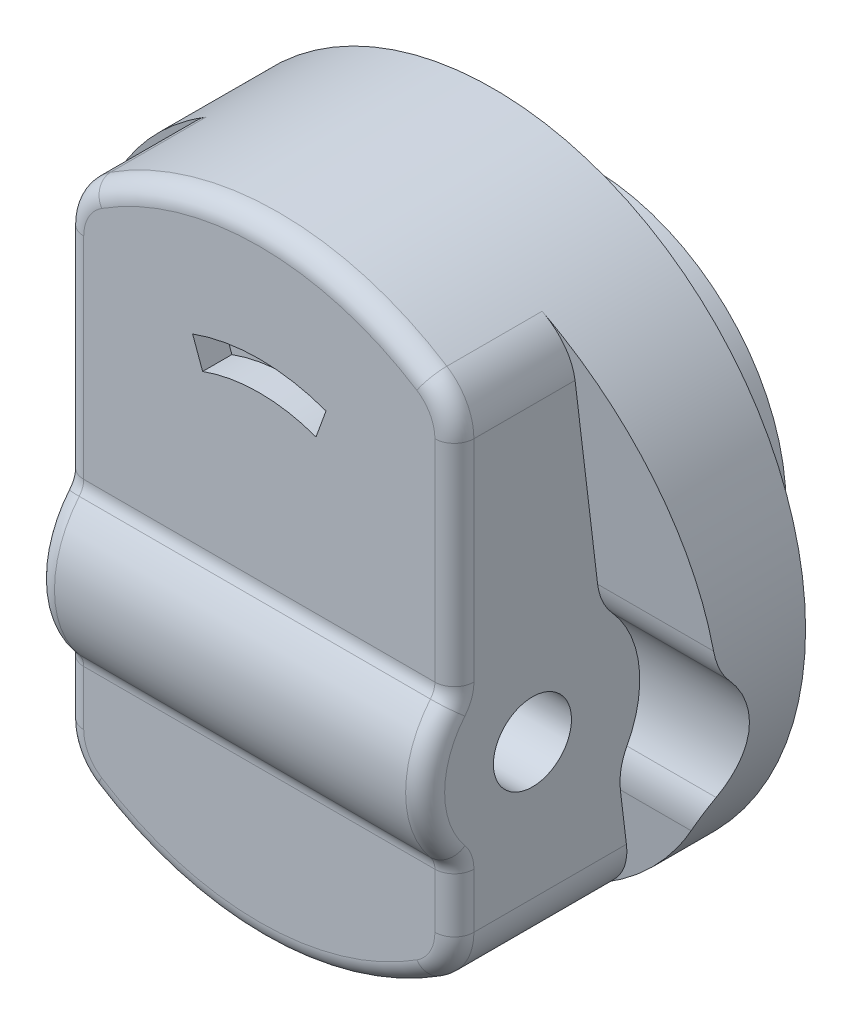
ISO-10303-21;
HEADER;
FILE_DESCRIPTION(('STEP AP214'),'2;1');
FILE_NAME('part.step','',(''),(''),'','','');
FILE_SCHEMA(('AUTOMOTIVE_DESIGN { 1 0 10303 214 1 1 1 1 }'));
ENDSEC;
DATA;
#1=APPLICATION_CONTEXT('core data for automotive mechanical design processes');
#2=APPLICATION_PROTOCOL_DEFINITION('international standard','automotive_design',2000,#1);
#3=PRODUCT_CONTEXT('',#1,'mechanical');
#4=PRODUCT('Part','Part','',(#3));
#5=PRODUCT_RELATED_PRODUCT_CATEGORY('part','',(#4));
#6=PRODUCT_DEFINITION_FORMATION('','',#4);
#7=PRODUCT_DEFINITION_CONTEXT('part definition',#1,'design');
#8=PRODUCT_DEFINITION('design','',#6,#7);
#9=PRODUCT_DEFINITION_SHAPE('','',#8);
#10=(LENGTH_UNIT() NAMED_UNIT(*) SI_UNIT(.MILLI.,.METRE.));
#11=(NAMED_UNIT(*) PLANE_ANGLE_UNIT() SI_UNIT($,.RADIAN.));
#12=(NAMED_UNIT(*) SI_UNIT($,.STERADIAN.) SOLID_ANGLE_UNIT());
#13=UNCERTAINTY_MEASURE_WITH_UNIT(LENGTH_MEASURE(1.E-05),#10,'distance_accuracy_value','');
#14=(GEOMETRIC_REPRESENTATION_CONTEXT(3) GLOBAL_UNCERTAINTY_ASSIGNED_CONTEXT((#13)) GLOBAL_UNIT_ASSIGNED_CONTEXT((#10,
#11,#12)) REPRESENTATION_CONTEXT('',''));
#15=CARTESIAN_POINT('',(0.,0.,0.));
#16=DIRECTION('',(0.,0.,1.));
#17=DIRECTION('',(1.,0.,0.));
#18=AXIS2_PLACEMENT_3D('',#15,#16,#17);
#19=CARTESIAN_POINT('',(0.,0.,-6.5));
#20=DIRECTION('',(0.,0.,1.));
#21=DIRECTION('',(1.,0.,0.));
#22=AXIS2_PLACEMENT_3D('',#19,#20,#21);
#23=CYLINDRICAL_SURFACE('',#22,5.);
#24=CARTESIAN_POINT('',(0.,0.,0.));
#25=DIRECTION('',(0.,0.,1.));
#26=DIRECTION('',(1.,0.,0.));
#27=AXIS2_PLACEMENT_3D('',#24,#25,#26);
#28=CIRCLE('',#27,5.);
#29=CARTESIAN_POINT('',(5.,0.,0.));
#30=VERTEX_POINT('',#29);
#31=EDGE_CURVE('E341',#30,#30,#28,.F.);
#32=CARTESIAN_POINT('',(0.,0.,-2.5));
#33=DIRECTION('',(0.,0.,-1.));
#34=DIRECTION('',(-1.,0.,0.));
#35=AXIS2_PLACEMENT_3D('',#32,#33,#34);
#36=CIRCLE('',#35,5.);
#37=CARTESIAN_POINT('',(5.,0.,-2.5));
#38=VERTEX_POINT('',#37);
#39=EDGE_CURVE('E638',#38,#38,#36,.T.);
#40=CARTESIAN_POINT('',(5.,0.,0.));
#41=CARTESIAN_POINT('',(5.,0.,-0.0260416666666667));
#42=CARTESIAN_POINT('',(5.,0.,-0.0520833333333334));
#43=CARTESIAN_POINT('',(5.,0.,-0.104166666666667));
#44=CARTESIAN_POINT('',(5.,0.,-0.130208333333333));
#45=CARTESIAN_POINT('',(5.,0.,-0.182291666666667));
#46=CARTESIAN_POINT('',(5.,0.,-0.208333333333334));
#47=CARTESIAN_POINT('',(5.,0.,-0.260416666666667));
#48=CARTESIAN_POINT('',(5.,0.,-0.286458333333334));
#49=CARTESIAN_POINT('',(5.,0.,-0.338541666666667));
#50=CARTESIAN_POINT('',(5.,0.,-0.364583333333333));
#51=CARTESIAN_POINT('',(5.,0.,-0.416666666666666));
#52=CARTESIAN_POINT('',(5.,0.,-0.442708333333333));
#53=CARTESIAN_POINT('',(5.,0.,-0.494791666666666));
#54=CARTESIAN_POINT('',(5.,0.,-0.520833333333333));
#55=CARTESIAN_POINT('',(5.,0.,-0.572916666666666));
#56=CARTESIAN_POINT('',(5.,0.,-0.598958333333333));
#57=CARTESIAN_POINT('',(5.,0.,-0.651041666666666));
#58=CARTESIAN_POINT('',(5.,0.,-0.677083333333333));
#59=CARTESIAN_POINT('',(5.,0.,-0.729166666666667));
#60=CARTESIAN_POINT('',(5.,0.,-0.755208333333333));
#61=CARTESIAN_POINT('',(5.,0.,-0.807291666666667));
#62=CARTESIAN_POINT('',(5.,0.,-0.833333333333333));
#63=CARTESIAN_POINT('',(5.,0.,-0.885416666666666));
#64=CARTESIAN_POINT('',(5.,0.,-0.911458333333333));
#65=CARTESIAN_POINT('',(5.,0.,-0.963541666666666));
#66=CARTESIAN_POINT('',(5.,0.,-0.989583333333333));
#67=CARTESIAN_POINT('',(5.,0.,-1.04166666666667));
#68=CARTESIAN_POINT('',(5.,0.,-1.06770833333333));
#69=CARTESIAN_POINT('',(5.,0.,-1.11979166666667));
#70=CARTESIAN_POINT('',(5.,0.,-1.14583333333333));
#71=CARTESIAN_POINT('',(5.,0.,-1.19791666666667));
#72=CARTESIAN_POINT('',(5.,0.,-1.22395833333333));
#73=CARTESIAN_POINT('',(5.,0.,-1.27604166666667));
#74=CARTESIAN_POINT('',(5.,0.,-1.30208333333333));
#75=CARTESIAN_POINT('',(5.,0.,-1.35416666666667));
#76=CARTESIAN_POINT('',(5.,0.,-1.38020833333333));
#77=CARTESIAN_POINT('',(5.,0.,-1.43229166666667));
#78=CARTESIAN_POINT('',(5.,0.,-1.45833333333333));
#79=CARTESIAN_POINT('',(5.,0.,-1.51041666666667));
#80=CARTESIAN_POINT('',(5.,0.,-1.53645833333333));
#81=CARTESIAN_POINT('',(5.,0.,-1.58854166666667));
#82=CARTESIAN_POINT('',(5.,0.,-1.61458333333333));
#83=CARTESIAN_POINT('',(5.,0.,-1.66666666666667));
#84=CARTESIAN_POINT('',(5.,0.,-1.69270833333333));
#85=CARTESIAN_POINT('',(5.,0.,-1.74479166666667));
#86=CARTESIAN_POINT('',(5.,0.,-1.77083333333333));
#87=CARTESIAN_POINT('',(5.,0.,-1.82291666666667));
#88=CARTESIAN_POINT('',(5.,0.,-1.84895833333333));
#89=CARTESIAN_POINT('',(5.,0.,-1.90104166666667));
#90=CARTESIAN_POINT('',(5.,0.,-1.92708333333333));
#91=CARTESIAN_POINT('',(5.,0.,-1.97916666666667));
#92=CARTESIAN_POINT('',(5.,0.,-2.00520833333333));
#93=CARTESIAN_POINT('',(5.,0.,-2.05729166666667));
#94=CARTESIAN_POINT('',(5.,0.,-2.08333333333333));
#95=CARTESIAN_POINT('',(5.,0.,-2.13541666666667));
#96=CARTESIAN_POINT('',(5.,0.,-2.16145833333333));
#97=CARTESIAN_POINT('',(5.,0.,-2.21354166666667));
#98=CARTESIAN_POINT('',(5.,0.,-2.23958333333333));
#99=CARTESIAN_POINT('',(5.,0.,-2.29166666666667));
#100=CARTESIAN_POINT('',(5.,0.,-2.31770833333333));
#101=CARTESIAN_POINT('',(5.,0.,-2.36979166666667));
#102=CARTESIAN_POINT('',(5.,0.,-2.39583333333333));
#103=CARTESIAN_POINT('',(5.,0.,-2.44791666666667));
#104=CARTESIAN_POINT('',(5.,0.,-2.47395833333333));
#105=CARTESIAN_POINT('',(5.,0.,-2.5));
#106=B_SPLINE_CURVE_WITH_KNOTS('',3,(#40,#41,#42,#43,#44,#45,#46,#47,#48,#49,#50,#51,#52,#53,
#54,#55,#56,#57,#58,#59,#60,#61,#62,#63,#64,#65,#66,#67,#68,#69,#70,#71,#72,#73,#74,#75,#76,#77,
#78,#79,#80,#81,#82,#83,#84,#85,#86,#87,#88,#89,#90,#91,#92,#93,#94,#95,#96,#97,#98,#99,#100,
#101,#102,#103,#104,#105),.UNSPECIFIED.,.F.,.F.,(4,2,2,2,2,2,2,2,2,2,2,2,2,2,2,2,2,2,2,2,2,2,2,
2,2,2,2,2,2,2,2,2,4),(0.,0.0781250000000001,0.15625,0.234375,0.3125,0.390625,0.46875,0.546875,
0.625,0.703125,0.78125,0.859375,0.937499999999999,1.015625,1.09375,1.171875,1.25,1.328125,
1.40625,1.484375,1.5625,1.640625,1.71875,1.796875,1.875,1.953125,2.03125,2.109375,2.1875,
2.265625,2.34375,2.421875,2.5),.UNSPECIFIED.);
#107=EDGE_CURVE('BSEAM31',#30,#38,#106,.T.);
#108=ORIENTED_EDGE('',*,*,#31,.T.);
#109=ORIENTED_EDGE('',*,*,#39,.F.);
#110=ORIENTED_EDGE('',*,*,#107,.T.);
#111=ORIENTED_EDGE('',*,*,#107,.F.);
#112=EDGE_LOOP('',(#108,#110,#109,#111));
#113=FACE_BOUND('',#112,.T.);
#114=ADVANCED_FACE('F31',(#113),#23,.T.);
#115=CARTESIAN_POINT('',(0.,0.,6.));
#116=DIRECTION('',(0.,0.,1.));
#117=DIRECTION('',(1.,0.,0.));
#118=AXIS2_PLACEMENT_3D('',#115,#116,#117);
#119=PLANE('',#118);
#120=DIRECTION('',(1.,0.,0.));
#121=VECTOR('',#120,1.);
#122=CARTESIAN_POINT('',(5.,0.0766559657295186,6.));
#123=LINE('',#122,#121);
#124=CARTESIAN_POINT('',(-4.5,0.0766559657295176,6.));
#125=VERTEX_POINT('',#124);
#126=CARTESIAN_POINT('',(4.5,0.0766559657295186,6.));
#127=VERTEX_POINT('',#126);
#128=EDGE_CURVE('E482',#125,#127,#123,.T.);
#129=ORIENTED_EDGE('',*,*,#128,.T.);
#130=DIRECTION('',(0.,1.,0.));
#131=VECTOR('',#130,1.);
#132=CARTESIAN_POINT('',(4.5,5.47722557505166,6.));
#133=LINE('',#132,#131);
#134=CARTESIAN_POINT('',(4.5,5.47722557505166,6.));
#135=VERTEX_POINT('',#134);
#136=EDGE_CURVE('E490',#127,#135,#133,.T.);
#137=ORIENTED_EDGE('',*,*,#136,.T.);
#138=CARTESIAN_POINT('',(3.5,5.47722557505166,6.));
#139=DIRECTION('',(0.,0.,1.));
#140=DIRECTION('',(1.,0.,0.));
#141=AXIS2_PLACEMENT_3D('',#138,#139,#140);
#142=CIRCLE('',#141,1.);
#143=CARTESIAN_POINT('',(4.03846153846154,6.31987566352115,6.));
#144=VERTEX_POINT('',#143);
#145=EDGE_CURVE('E488',#135,#144,#142,.T.);
#146=ORIENTED_EDGE('',*,*,#145,.T.);
#147=CARTESIAN_POINT('',(0.,0.,6.));
#148=DIRECTION('',(0.,0.,1.));
#149=DIRECTION('',(1.,0.,0.));
#150=AXIS2_PLACEMENT_3D('',#147,#148,#149);
#151=CIRCLE('',#150,7.5);
#152=CARTESIAN_POINT('',(-4.03846153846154,6.31987566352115,6.));
#153=VERTEX_POINT('',#152);
#154=EDGE_CURVE('E486',#144,#153,#151,.T.);
#155=ORIENTED_EDGE('',*,*,#154,.T.);
#156=CARTESIAN_POINT('',(-3.5,5.47722557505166,6.));
#157=DIRECTION('',(0.,0.,1.));
#158=DIRECTION('',(1.,0.,0.));
#159=AXIS2_PLACEMENT_3D('',#156,#157,#158);
#160=CIRCLE('',#159,1.);
#161=CARTESIAN_POINT('',(-4.5,5.47722557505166,6.));
#162=VERTEX_POINT('',#161);
#163=EDGE_CURVE('E484',#153,#162,#160,.T.);
#164=ORIENTED_EDGE('',*,*,#163,.T.);
#165=DIRECTION('',(0.,-1.,0.));
#166=VECTOR('',#165,1.);
#167=CARTESIAN_POINT('',(-4.5,-0.112541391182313,6.));
#168=LINE('',#167,#166);
#169=EDGE_CURVE('E480',#162,#125,#168,.T.);
#170=ORIENTED_EDGE('',*,*,#169,.T.);
#171=EDGE_LOOP('',(#129,#137,#146,#155,#164,#170));
#172=FACE_BOUND('',#171,.T.);
#173=DIRECTION('',(-0.341820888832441,-0.939765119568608,0.));
#174=VECTOR('',#173,1.);
#175=CARTESIAN_POINT('',(-1.99574380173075,-5.48762052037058,6.));
#176=LINE('',#175,#174);
#177=CARTESIAN_POINT('',(1.70934211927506,4.69873914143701,6.));
#178=VERTEX_POINT('',#177);
#179=CARTESIAN_POINT('',(1.45297645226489,3.99391530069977,6.));
#180=VERTEX_POINT('',#179);
#181=EDGE_CURVE('E253',#178,#180,#176,.T.);
#182=ORIENTED_EDGE('',*,*,#181,.T.);
#183=CARTESIAN_POINT('',(0.,0.,6.));
#184=DIRECTION('',(0.,0.,1.));
#185=DIRECTION('',(1.,0.,0.));
#186=AXIS2_PLACEMENT_3D('',#183,#184,#185);
#187=CIRCLE('',#186,4.25);
#188=CARTESIAN_POINT('',(-1.45276144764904,3.99399351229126,6.));
#189=VERTEX_POINT('',#188);
#190=EDGE_CURVE('E258',#180,#189,#187,.T.);
#191=ORIENTED_EDGE('',*,*,#190,.T.);
#192=DIRECTION('',(0.342020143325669,-0.939692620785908,0.));
#193=VECTOR('',#192,1.);
#194=CARTESIAN_POINT('',(1.99781503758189,-5.48638746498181,6.));
#195=LINE('',#194,#193);
#196=CARTESIAN_POINT('',(-1.70927655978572,4.69876299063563,6.));
#197=VERTEX_POINT('',#196);
#198=EDGE_CURVE('E262',#197,#189,#195,.T.);
#199=ORIENTED_EDGE('',*,*,#198,.F.);
#200=CARTESIAN_POINT('',(0.,0.,6.));
#201=DIRECTION('',(0.,0.,1.));
#202=DIRECTION('',(1.,0.,0.));
#203=AXIS2_PLACEMENT_3D('',#200,#201,#202);
#204=CIRCLE('',#203,5.);
#205=EDGE_CURVE('E242',#178,#197,#204,.T.);
#206=ORIENTED_EDGE('',*,*,#205,.F.);
#207=EDGE_LOOP('',(#182,#191,#199,#206));
#208=FACE_BOUND('',#207,.T.);
#209=ADVANCED_FACE('F260',(#172,#208),#119,.T.);
#210=CARTESIAN_POINT('',(8.,6.2449979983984,3.));
#211=DIRECTION('',(0.,-0.119239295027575,0.992865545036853));
#212=DIRECTION('',(0.,-0.992865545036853,-0.119239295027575));
#213=AXIS2_PLACEMENT_3D('',#210,#211,#212);
#214=PLANE('',#213);
#215=DIRECTION('',(0.,0.992865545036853,0.119239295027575));
#216=VECTOR('',#215,1.);
#217=CARTESIAN_POINT('',(5.,6.2449979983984,3.));
#218=LINE('',#217,#216);
#219=CARTESIAN_POINT('',(5.,0.663567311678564,2.32969185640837));
#220=VERTEX_POINT('',#219);
#221=CARTESIAN_POINT('',(5.,5.47722557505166,2.90779351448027));
#222=VERTEX_POINT('',#221);
#223=EDGE_CURVE('E330',#220,#222,#218,.T.);
#224=ORIENTED_EDGE('',*,*,#223,.F.);
#225=DIRECTION('',(1.,0.,0.));
#226=VECTOR('',#225,1.);
#227=CARTESIAN_POINT('',(7.99886847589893,0.663567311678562,2.32969185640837));
#228=LINE('',#227,#226);
#229=CARTESIAN_POINT('',(7.97243240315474,0.663567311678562,2.32969185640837));
#230=VERTEX_POINT('',#229);
#231=EDGE_CURVE('E436',#220,#230,#228,.T.);
#232=ORIENTED_EDGE('',*,*,#231,.T.);
#233=CARTESIAN_POINT('',(0.,0.,2.25));
#234=DIRECTION('',(0.,-0.119239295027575,0.992865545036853));
#235=DIRECTION('',(0.,-0.992865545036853,-0.119239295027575));
#236=AXIS2_PLACEMENT_3D('',#233,#234,#235);
#237=ELLIPSE('',#236,8.05748576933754,8.);
#238=CARTESIAN_POINT('',(4.30769230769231,6.74120070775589,3.05959201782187));
#239=VERTEX_POINT('',#238);
#240=EDGE_CURVE('E334',#230,#239,#237,.T.);
#241=ORIENTED_EDGE('',*,*,#240,.T.);
#242=CARTESIAN_POINT('',(3.5,5.47722557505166,2.90779351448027));
#243=DIRECTION('',(0.,-0.119239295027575,0.992865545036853));
#244=DIRECTION('',(0.,-0.992865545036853,-0.119239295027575));
#245=AXIS2_PLACEMENT_3D('',#242,#243,#244);
#246=ELLIPSE('',#245,1.51077858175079,1.5);
#247=EDGE_CURVE('E373',#239,#222,#246,.F.);
#248=ORIENTED_EDGE('',*,*,#247,.T.);
#249=EDGE_LOOP('',(#224,#232,#241,#248));
#250=FACE_BOUND('',#249,.T.);
#251=ADVANCED_FACE('F580',(#250),#214,.T.);
#252=CARTESIAN_POINT('',(0.,0.,6.));
#253=DIRECTION('',(0.,0.,-1.));
#254=DIRECTION('',(-1.,0.,0.));
#255=AXIS2_PLACEMENT_3D('',#252,#253,#254);
#256=CYLINDRICAL_SURFACE('',#255,8.);
#257=CARTESIAN_POINT('',(0.,0.,0.));
#258=DIRECTION('',(0.,0.,1.));
#259=DIRECTION('',(1.,0.,0.));
#260=AXIS2_PLACEMENT_3D('',#257,#258,#259);
#261=CIRCLE('',#260,8.);
#262=CARTESIAN_POINT('',(8.,0.,0.));
#263=VERTEX_POINT('',#262);
#264=EDGE_CURVE('E338',#263,#263,#261,.T.);
#265=ORIENTED_EDGE('',*,*,#264,.T.);
#266=EDGE_LOOP('',(#265));
#267=FACE_BOUND('',#266,.T.);
#268=DIRECTION('',(0.,0.,-1.));
#269=VECTOR('',#268,1.);
#270=CARTESIAN_POINT('',(4.30769230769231,-6.74120070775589,6.));
#271=LINE('',#270,#269);
#272=CARTESIAN_POINT('',(4.30769230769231,-6.74120070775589,1.44040798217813));
#273=VERTEX_POINT('',#272);
#274=CARTESIAN_POINT('',(4.30769230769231,-6.74120070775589,5.5));
#275=VERTEX_POINT('',#274);
#276=EDGE_CURVE('E348',#273,#275,#271,.F.);
#277=ORIENTED_EDGE('',*,*,#276,.T.);
#278=CARTESIAN_POINT('',(0.,0.,5.5));
#279=DIRECTION('',(0.,0.,1.));
#280=DIRECTION('',(1.,0.,0.));
#281=AXIS2_PLACEMENT_3D('',#278,#279,#280);
#282=CIRCLE('',#281,8.);
#283=CARTESIAN_POINT('',(-4.30769230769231,-6.74120070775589,5.5));
#284=VERTEX_POINT('',#283);
#285=EDGE_CURVE('E476',#275,#284,#282,.F.);
#286=ORIENTED_EDGE('',*,*,#285,.T.);
#287=DIRECTION('',(0.,0.,-1.));
#288=VECTOR('',#287,1.);
#289=CARTESIAN_POINT('',(-4.30769230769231,-6.74120070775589,6.));
#290=LINE('',#289,#288);
#291=CARTESIAN_POINT('',(-4.30769230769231,-6.74120070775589,1.44040798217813));
#292=VERTEX_POINT('',#291);
#293=EDGE_CURVE('E354',#284,#292,#290,.T.);
#294=ORIENTED_EDGE('',*,*,#293,.T.);
#295=CARTESIAN_POINT('',(0.,0.,2.25));
#296=DIRECTION('',(0.,0.119239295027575,-0.992865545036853));
#297=DIRECTION('',(0.,-0.992865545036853,-0.119239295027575));
#298=AXIS2_PLACEMENT_3D('',#295,#296,#297);
#299=ELLIPSE('',#298,8.05748576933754,8.);
#300=CARTESIAN_POINT('',(-6.81353986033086,-4.1923352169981,1.74651682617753));
#301=VERTEX_POINT('',#300);
#302=EDGE_CURVE('E327',#292,#301,#299,.T.);
#303=ORIENTED_EDGE('',*,*,#302,.T.);
#304=CARTESIAN_POINT('',(-6.81353986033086,-4.1923352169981,1.74651682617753));
#305=CARTESIAN_POINT('',(-6.84124914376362,-4.14730445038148,1.75191852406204));
#306=CARTESIAN_POINT('',(-6.86860403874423,-4.10184089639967,1.75531098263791));
#307=CARTESIAN_POINT('',(-6.92247932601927,-4.01025005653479,1.75791770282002));
#308=CARTESIAN_POINT('',(-6.94899893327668,-3.96412220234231,1.75712814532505));
#309=CARTESIAN_POINT('',(-7.02570220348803,-3.82755362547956,1.74838940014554));
#310=CARTESIAN_POINT('',(-7.0744715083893,-3.73658326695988,1.7343593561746));
#311=CARTESIAN_POINT('',(-7.15039758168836,-3.58833006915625,1.69696170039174));
#312=CARTESIAN_POINT('',(-7.17909734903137,-3.53051300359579,1.67865219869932));
#313=CARTESIAN_POINT('',(-7.23448251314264,-3.4156167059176,1.63432427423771));
#314=CARTESIAN_POINT('',(-7.26112783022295,-3.35856452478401,1.60818597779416));
#315=CARTESIAN_POINT('',(-7.28637522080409,-3.30283758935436,1.57820021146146));
#316=B_SPLINE_CURVE_WITH_KNOTS('',3,(#304,#305,#306,#307,#308,#309,#310,#311,#312,#313,#314,
#315),.UNSPECIFIED.,.F.,.F.,(4,2,2,2,2,4),(0.,0.15935314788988,0.318851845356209,
0.629642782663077,0.830503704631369,1.03461276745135),.UNSPECIFIED.);
#317=CARTESIAN_POINT('',(-7.28637522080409,-3.30283758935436,1.57820021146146));
#318=VERTEX_POINT('',#317);
#319=EDGE_CURVE('E421',#301,#318,#316,.T.);
#320=ORIENTED_EDGE('',*,*,#319,.T.);
#321=CARTESIAN_POINT('',(-7.99920836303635,-0.112541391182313,6.));
#322=CARTESIAN_POINT('',(-7.99999813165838,-0.0564205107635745,5.94704789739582));
#323=CARTESIAN_POINT('',(-8.00016516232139,-0.00254012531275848,5.89172357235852));
#324=CARTESIAN_POINT('',(-7.99953571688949,0.100375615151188,5.77675626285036));
#325=CARTESIAN_POINT('',(-7.99873937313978,0.149411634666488,5.71711387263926));
#326=CARTESIAN_POINT('',(-7.99646605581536,0.242255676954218,5.59396725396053));
#327=CARTESIAN_POINT('',(-7.99498958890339,0.286067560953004,5.53046593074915));
#328=CARTESIAN_POINT('',(-7.99162797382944,0.368194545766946,5.40003645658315));
#329=CARTESIAN_POINT('',(-7.98974282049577,0.406509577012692,5.33310826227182));
#330=CARTESIAN_POINT('',(-7.98386555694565,0.512801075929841,5.12783909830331));
#331=CARTESIAN_POINT('',(-7.97964929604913,0.57219025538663,4.98492542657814));
#332=CARTESIAN_POINT('',(-7.9723556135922,0.6661713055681,4.69125121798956));
#333=CARTESIAN_POINT('',(-7.9692779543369,0.700768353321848,4.54049232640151));
#334=CARTESIAN_POINT('',(-7.96533096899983,0.744305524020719,4.23485955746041));
#335=CARTESIAN_POINT('',(-7.96446740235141,0.75317874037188,4.07997600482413));
#336=CARTESIAN_POINT('',(-7.96525517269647,0.744799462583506,3.77090765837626));
#337=CARTESIAN_POINT('',(-7.96690686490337,0.72754327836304,3.61672296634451));
#338=CARTESIAN_POINT('',(-7.97215798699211,0.667523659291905,3.31404690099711));
#339=CARTESIAN_POINT('',(-7.97575003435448,0.624856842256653,3.1655362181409));
#340=CARTESIAN_POINT('',(-7.98357413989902,0.515306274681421,2.87775145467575));
#341=CARTESIAN_POINT('',(-7.98780620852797,0.448422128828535,2.73847752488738));
#342=CARTESIAN_POINT('',(-7.99505466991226,0.291954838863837,2.47246768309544));
#343=CARTESIAN_POINT('',(-7.99806574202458,0.202275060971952,2.3457884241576));
#344=CARTESIAN_POINT('',(-8.00061890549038,0.00288235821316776,2.10926431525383));
#345=CARTESIAN_POINT('',(-8.00016114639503,-0.106829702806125,1.99941873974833));
#346=CARTESIAN_POINT('',(-7.99353955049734,-0.342101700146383,1.80059156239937));
#347=CARTESIAN_POINT('',(-7.98742217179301,-0.467525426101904,1.7114474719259));
#348=CARTESIAN_POINT('',(-7.96762451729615,-0.731009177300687,1.5554994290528));
#349=CARTESIAN_POINT('',(-7.95394623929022,-0.86906585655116,1.48868958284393));
#350=CARTESIAN_POINT('',(-7.91821176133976,-1.14950186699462,1.38062406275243));
#351=CARTESIAN_POINT('',(-7.89638997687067,-1.29166611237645,1.33873137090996));
#352=CARTESIAN_POINT('',(-7.84392945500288,-1.57928219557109,1.27840300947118));
#353=CARTESIAN_POINT('',(-7.81329086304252,-1.72473397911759,1.25996695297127));
#354=CARTESIAN_POINT('',(-7.74356622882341,-2.01481110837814,1.24620348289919));
#355=CARTESIAN_POINT('',(-7.70447172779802,-2.15943547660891,1.25089931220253));
#356=CARTESIAN_POINT('',(-7.61897740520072,-2.44403133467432,1.28230749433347));
#357=CARTESIAN_POINT('',(-7.57257567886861,-2.58400159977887,1.30902559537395));
#358=CARTESIAN_POINT('',(-7.47093334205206,-2.86511974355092,1.38530471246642));
#359=CARTESIAN_POINT('',(-7.41531530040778,-3.005759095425,1.43623043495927));
#360=CARTESIAN_POINT('',(-7.30010287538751,-3.27567927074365,1.55926769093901));
#361=CARTESIAN_POINT('',(-7.24050668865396,-3.40495488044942,1.63138888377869));
#362=CARTESIAN_POINT('',(-7.11436208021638,-3.66172109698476,1.80290243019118));
#363=CARTESIAN_POINT('',(-7.04769422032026,-3.78785643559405,1.90424435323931));
#364=CARTESIAN_POINT('',(-6.91713736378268,-4.02133551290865,2.12838160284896));
#365=CARTESIAN_POINT('',(-6.85325124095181,-4.12866014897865,2.25119848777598));
#366=CARTESIAN_POINT('',(-6.73195439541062,-4.32368832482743,2.51977634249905));
#367=CARTESIAN_POINT('',(-6.67472850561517,-4.41087832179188,2.66600390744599));
#368=CARTESIAN_POINT('',(-6.60009750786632,-4.5211389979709,2.89831486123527));
#369=CARTESIAN_POINT('',(-6.5770981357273,-4.55445903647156,2.97786573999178));
#370=CARTESIAN_POINT('',(-6.53563492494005,-4.61375953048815,3.1407738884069));
#371=CARTESIAN_POINT('',(-6.51716891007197,-4.6397435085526,3.22412930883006));
#372=CARTESIAN_POINT('',(-6.47885231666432,-4.69318669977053,3.43005318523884));
#373=CARTESIAN_POINT('',(-6.4617456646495,-4.71658393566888,3.55423786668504));
#374=CARTESIAN_POINT('',(-6.44014427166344,-4.74603917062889,3.80564588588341));
#375=CARTESIAN_POINT('',(-6.43563984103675,-4.75211049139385,3.93286681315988));
#376=CARTESIAN_POINT('',(-6.43971370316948,-4.74658789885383,4.18678274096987));
#377=CARTESIAN_POINT('',(-6.44829928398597,-4.7349841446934,4.31347740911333));
#378=CARTESIAN_POINT('',(-6.47762507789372,-4.69478146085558,4.56267639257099));
#379=CARTESIAN_POINT('',(-6.49837006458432,-4.66617585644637,4.68517904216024));
#380=CARTESIAN_POINT('',(-6.5502967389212,-4.5929976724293,4.9245091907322));
#381=CARTESIAN_POINT('',(-6.58159571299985,-4.54824524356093,5.04125521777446));
#382=CARTESIAN_POINT('',(-6.65208528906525,-4.44451223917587,5.26577160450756));
#383=CARTESIAN_POINT('',(-6.69128454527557,-4.38551604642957,5.37353193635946));
#384=CARTESIAN_POINT('',(-6.77280222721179,-4.25846378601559,5.57324469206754));
#385=CARTESIAN_POINT('',(-6.81483965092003,-4.19106533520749,5.6657355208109));
#386=CARTESIAN_POINT('',(-6.90172570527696,-4.04639995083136,5.84052863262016));
#387=CARTESIAN_POINT('',(-6.94656305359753,-3.96917146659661,5.92286827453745));
#388=CARTESIAN_POINT('',(-6.99197150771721,-3.88745860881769,6.));
#389=B_SPLINE_CURVE_WITH_KNOTS('',3,(#321,#322,#323,#324,#325,#326,#327,#328,#329,#330,#331,
#332,#333,#334,#335,#336,#337,#338,#339,#340,#341,#342,#343,#344,#345,#346,#347,#348,#349,#350,
#351,#352,#353,#354,#355,#356,#357,#358,#359,#360,#361,#362,#363,#364,#365,#366,#367,#368,#369,
#370,#371,#372,#373,#374,#375,#376,#377,#378,#379,#380,#381,#382,#383,#384,#385,#386,#387,#388),
.UNSPECIFIED.,.F.,.F.,(4,2,2,2,2,2,2,2,2,2,2,2,2,2,2,2,2,2,2,2,2,2,2,2,2,2,2,2,2,2,2,2,2,4),(0.,
0.231405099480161,0.462778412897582,0.69397964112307,0.925183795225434,1.38726533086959,
1.84925034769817,2.3124358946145,2.77568686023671,3.23718757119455,3.69869581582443,
4.16219406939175,4.62567234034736,5.08537949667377,5.54496524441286,5.99223092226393,
6.43948922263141,6.88719701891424,7.33502171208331,7.81178865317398,8.28877320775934,
8.81141370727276,9.33458192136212,9.86989969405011,10.1372621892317,10.4044960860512,
10.7852472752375,11.165705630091,11.5463758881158,11.9271956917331,12.3123952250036,
12.6980190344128,13.0629104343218,13.4264160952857),.UNSPECIFIED.);
#390=CARTESIAN_POINT('',(-7.99838413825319,-0.160783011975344,1.95554876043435));
#391=VERTEX_POINT('',#390);
#392=EDGE_CURVE('E309',#391,#318,#389,.T.);
#393=ORIENTED_EDGE('',*,*,#392,.F.);
#394=CARTESIAN_POINT('',(-7.99838413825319,-0.160783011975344,1.95554876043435));
#395=CARTESIAN_POINT('',(-7.99901616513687,-0.129356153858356,1.9838202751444));
#396=CARTESIAN_POINT('',(-7.99948585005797,-0.0967479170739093,2.0107504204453));
#397=CARTESIAN_POINT('',(-8.00001707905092,-0.0293711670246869,2.06176864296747));
#398=CARTESIAN_POINT('',(-8.00007858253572,0.00539756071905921,2.08585643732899));
#399=CARTESIAN_POINT('',(-7.99953520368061,0.110741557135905,2.1524154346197));
#400=CARTESIAN_POINT('',(-7.99824398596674,0.184040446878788,2.19068970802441));
#401=CARTESIAN_POINT('',(-7.99370407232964,0.323649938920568,2.24952853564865));
#402=CARTESIAN_POINT('',(-7.99080115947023,0.389205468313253,2.27194574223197));
#403=CARTESIAN_POINT('',(-7.98310887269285,0.52414229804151,2.3079418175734));
#404=CARTESIAN_POINT('',(-7.97827947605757,0.593575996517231,2.32131580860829));
#405=CARTESIAN_POINT('',(-7.97243240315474,0.663567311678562,2.32969185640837));
#406=B_SPLINE_CURVE_WITH_KNOTS('',3,(#394,#395,#396,#397,#398,#399,#400,#401,#402,#403,#404,
#405),.UNSPECIFIED.,.F.,.F.,(4,2,2,2,2,4),(0.,0.126749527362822,0.25351165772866,
0.500335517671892,0.707716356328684,0.919650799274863),.UNSPECIFIED.);
#407=CARTESIAN_POINT('',(-7.97243240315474,0.663567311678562,2.32969185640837));
#408=VERTEX_POINT('',#407);
#409=EDGE_CURVE('E416',#391,#408,#406,.T.);
#410=ORIENTED_EDGE('',*,*,#409,.T.);
#411=CARTESIAN_POINT('',(-4.30769230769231,6.74120070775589,3.05959201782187));
#412=VERTEX_POINT('',#411);
#413=EDGE_CURVE('E326',#408,#412,#299,.T.);
#414=ORIENTED_EDGE('',*,*,#413,.T.);
#415=DIRECTION('',(0.,0.,-1.));
#416=VECTOR('',#415,1.);
#417=CARTESIAN_POINT('',(-4.30769230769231,6.74120070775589,6.));
#418=LINE('',#417,#416);
#419=CARTESIAN_POINT('',(-4.30769230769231,6.74120070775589,5.5));
#420=VERTEX_POINT('',#419);
#421=EDGE_CURVE('E351',#412,#420,#418,.F.);
#422=ORIENTED_EDGE('',*,*,#421,.T.);
#423=CARTESIAN_POINT('',(0.,0.,5.5));
#424=DIRECTION('',(0.,0.,1.));
#425=DIRECTION('',(1.,0.,0.));
#426=AXIS2_PLACEMENT_3D('',#423,#424,#425);
#427=CIRCLE('',#426,8.);
#428=CARTESIAN_POINT('',(4.30769230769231,6.74120070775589,5.5));
#429=VERTEX_POINT('',#428);
#430=EDGE_CURVE('E474',#420,#429,#427,.F.);
#431=ORIENTED_EDGE('',*,*,#430,.T.);
#432=DIRECTION('',(0.,0.,-1.));
#433=VECTOR('',#432,1.);
#434=CARTESIAN_POINT('',(4.30769230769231,6.74120070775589,6.));
#435=LINE('',#434,#433);
#436=EDGE_CURVE('E344',#429,#239,#435,.T.);
#437=ORIENTED_EDGE('',*,*,#436,.T.);
#438=ORIENTED_EDGE('',*,*,#240,.F.);
#439=CARTESIAN_POINT('',(7.97243240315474,0.663567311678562,2.32969185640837));
#440=CARTESIAN_POINT('',(7.97591086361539,0.621797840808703,2.32467554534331));
#441=CARTESIAN_POINT('',(7.97903772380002,0.580232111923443,2.31789982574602));
#442=CARTESIAN_POINT('',(7.98460559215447,0.49777163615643,2.30086863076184));
#443=CARTESIAN_POINT('',(7.98704657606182,0.456876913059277,2.29061303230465));
#444=CARTESIAN_POINT('',(7.99325538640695,0.337729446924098,2.25531687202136));
#445=CARTESIAN_POINT('',(7.99608965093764,0.260785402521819,2.22547365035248));
#446=CARTESIAN_POINT('',(7.99927520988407,0.124485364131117,2.15924602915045));
#447=CARTESIAN_POINT('',(7.99994651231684,0.0642648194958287,2.12462463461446));
#448=CARTESIAN_POINT('',(8.00004896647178,-0.0521015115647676,2.04656681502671));
#449=CARTESIAN_POINT('',(7.99945252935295,-0.108128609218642,2.0029533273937));
#450=CARTESIAN_POINT('',(7.99838413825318,-0.160783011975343,1.95554876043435));
#451=B_SPLINE_CURVE_WITH_KNOTS('',3,(#439,#440,#441,#442,#443,#444,#445,#446,#447,#448,#449,
#450),.UNSPECIFIED.,.F.,.F.,(4,2,2,2,2,4),(0.,0.126557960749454,0.253120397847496,
0.499575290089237,0.707330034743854,0.919652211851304),.UNSPECIFIED.);
#452=CARTESIAN_POINT('',(7.99838413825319,-0.160783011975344,1.95554876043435));
#453=VERTEX_POINT('',#452);
#454=EDGE_CURVE('E384',#230,#453,#451,.T.);
#455=ORIENTED_EDGE('',*,*,#454,.T.);
#456=CARTESIAN_POINT('',(7.99920836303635,-0.112541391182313,6.));
#457=CARTESIAN_POINT('',(7.99999813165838,-0.0564205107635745,5.94704789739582));
#458=CARTESIAN_POINT('',(8.00016516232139,-0.00254012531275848,5.89172357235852));
#459=CARTESIAN_POINT('',(7.99953571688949,0.100375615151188,5.77675626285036));
#460=CARTESIAN_POINT('',(7.99873937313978,0.149411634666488,5.71711387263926));
#461=CARTESIAN_POINT('',(7.99646605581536,0.242255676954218,5.59396725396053));
#462=CARTESIAN_POINT('',(7.99498958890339,0.286067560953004,5.53046593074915));
#463=CARTESIAN_POINT('',(7.99162797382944,0.368194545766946,5.40003645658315));
#464=CARTESIAN_POINT('',(7.98974282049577,0.406509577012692,5.33310826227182));
#465=CARTESIAN_POINT('',(7.98386555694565,0.512801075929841,5.12783909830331));
#466=CARTESIAN_POINT('',(7.97964929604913,0.57219025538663,4.98492542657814));
#467=CARTESIAN_POINT('',(7.9723556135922,0.6661713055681,4.69125121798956));
#468=CARTESIAN_POINT('',(7.9692779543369,0.700768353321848,4.54049232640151));
#469=CARTESIAN_POINT('',(7.96533096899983,0.744305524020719,4.23485955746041));
#470=CARTESIAN_POINT('',(7.96446740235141,0.75317874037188,4.07997600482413));
#471=CARTESIAN_POINT('',(7.96525517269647,0.744799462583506,3.77090765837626));
#472=CARTESIAN_POINT('',(7.96690686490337,0.72754327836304,3.61672296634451));
#473=CARTESIAN_POINT('',(7.97215798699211,0.667523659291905,3.31404690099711));
#474=CARTESIAN_POINT('',(7.97575003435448,0.624856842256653,3.1655362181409));
#475=CARTESIAN_POINT('',(7.98357413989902,0.515306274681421,2.87775145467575));
#476=CARTESIAN_POINT('',(7.98780620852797,0.448422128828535,2.73847752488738));
#477=CARTESIAN_POINT('',(7.99505466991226,0.291954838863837,2.47246768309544));
#478=CARTESIAN_POINT('',(7.99806574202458,0.202275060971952,2.3457884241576));
#479=CARTESIAN_POINT('',(8.00061890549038,0.00288235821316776,2.10926431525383));
#480=CARTESIAN_POINT('',(8.00016114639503,-0.106829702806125,1.99941873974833));
#481=CARTESIAN_POINT('',(7.99353955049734,-0.342101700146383,1.80059156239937));
#482=CARTESIAN_POINT('',(7.98742217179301,-0.467525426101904,1.7114474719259));
#483=CARTESIAN_POINT('',(7.96762451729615,-0.731009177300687,1.5554994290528));
#484=CARTESIAN_POINT('',(7.95394623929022,-0.86906585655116,1.48868958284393));
#485=CARTESIAN_POINT('',(7.91821176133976,-1.14950186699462,1.38062406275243));
#486=CARTESIAN_POINT('',(7.89638997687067,-1.29166611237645,1.33873137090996));
#487=CARTESIAN_POINT('',(7.84392945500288,-1.57928219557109,1.27840300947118));
#488=CARTESIAN_POINT('',(7.81329086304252,-1.72473397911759,1.25996695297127));
#489=CARTESIAN_POINT('',(7.74356622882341,-2.01481110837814,1.24620348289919));
#490=CARTESIAN_POINT('',(7.70447172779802,-2.15943547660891,1.25089931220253));
#491=CARTESIAN_POINT('',(7.61897740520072,-2.44403133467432,1.28230749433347));
#492=CARTESIAN_POINT('',(7.57257567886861,-2.58400159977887,1.30902559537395));
#493=CARTESIAN_POINT('',(7.47093334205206,-2.86511974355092,1.38530471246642));
#494=CARTESIAN_POINT('',(7.41531530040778,-3.005759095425,1.43623043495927));
#495=CARTESIAN_POINT('',(7.30010287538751,-3.27567927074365,1.55926769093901));
#496=CARTESIAN_POINT('',(7.24050668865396,-3.40495488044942,1.63138888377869));
#497=CARTESIAN_POINT('',(7.11436208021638,-3.66172109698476,1.80290243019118));
#498=CARTESIAN_POINT('',(7.04769422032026,-3.78785643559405,1.90424435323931));
#499=CARTESIAN_POINT('',(6.91713736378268,-4.02133551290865,2.12838160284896));
#500=CARTESIAN_POINT('',(6.85325124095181,-4.12866014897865,2.25119848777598));
#501=CARTESIAN_POINT('',(6.73195439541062,-4.32368832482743,2.51977634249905));
#502=CARTESIAN_POINT('',(6.67472850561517,-4.41087832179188,2.66600390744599));
#503=CARTESIAN_POINT('',(6.60009750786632,-4.5211389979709,2.89831486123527));
#504=CARTESIAN_POINT('',(6.5770981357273,-4.55445903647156,2.97786573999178));
#505=CARTESIAN_POINT('',(6.53563492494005,-4.61375953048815,3.1407738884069));
#506=CARTESIAN_POINT('',(6.51716891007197,-4.6397435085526,3.22412930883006));
#507=CARTESIAN_POINT('',(6.47885231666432,-4.69318669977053,3.43005318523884));
#508=CARTESIAN_POINT('',(6.4617456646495,-4.71658393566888,3.55423786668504));
#509=CARTESIAN_POINT('',(6.44014427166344,-4.74603917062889,3.80564588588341));
#510=CARTESIAN_POINT('',(6.43563984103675,-4.75211049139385,3.93286681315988));
#511=CARTESIAN_POINT('',(6.43971370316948,-4.74658789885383,4.18678274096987));
#512=CARTESIAN_POINT('',(6.44829928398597,-4.7349841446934,4.31347740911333));
#513=CARTESIAN_POINT('',(6.47762507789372,-4.69478146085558,4.56267639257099));
#514=CARTESIAN_POINT('',(6.49837006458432,-4.66617585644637,4.68517904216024));
#515=CARTESIAN_POINT('',(6.5502967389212,-4.5929976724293,4.9245091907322));
#516=CARTESIAN_POINT('',(6.58159571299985,-4.54824524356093,5.04125521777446));
#517=CARTESIAN_POINT('',(6.65208528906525,-4.44451223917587,5.26577160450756));
#518=CARTESIAN_POINT('',(6.69128454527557,-4.38551604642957,5.37353193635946));
#519=CARTESIAN_POINT('',(6.77280222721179,-4.25846378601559,5.57324469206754));
#520=CARTESIAN_POINT('',(6.81483965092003,-4.19106533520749,5.6657355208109));
#521=CARTESIAN_POINT('',(6.90172570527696,-4.04639995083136,5.84052863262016));
#522=CARTESIAN_POINT('',(6.94656305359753,-3.96917146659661,5.92286827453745));
#523=CARTESIAN_POINT('',(6.99197150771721,-3.88745860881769,6.));
#524=B_SPLINE_CURVE_WITH_KNOTS('',3,(#456,#457,#458,#459,#460,#461,#462,#463,#464,#465,#466,
#467,#468,#469,#470,#471,#472,#473,#474,#475,#476,#477,#478,#479,#480,#481,#482,#483,#484,#485,
#486,#487,#488,#489,#490,#491,#492,#493,#494,#495,#496,#497,#498,#499,#500,#501,#502,#503,#504,
#505,#506,#507,#508,#509,#510,#511,#512,#513,#514,#515,#516,#517,#518,#519,#520,#521,#522,#523),
.UNSPECIFIED.,.F.,.F.,(4,2,2,2,2,2,2,2,2,2,2,2,2,2,2,2,2,2,2,2,2,2,2,2,2,2,2,2,2,2,2,2,2,4),(0.,
0.231405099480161,0.462778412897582,0.69397964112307,0.925183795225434,1.38726533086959,
1.84925034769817,2.3124358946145,2.77568686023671,3.23718757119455,3.69869581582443,
4.16219406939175,4.62567234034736,5.08537949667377,5.54496524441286,5.99223092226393,
6.43948922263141,6.88719701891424,7.33502171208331,7.81178865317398,8.28877320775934,
8.81141370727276,9.33458192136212,9.86989969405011,10.1372621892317,10.4044960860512,
10.7852472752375,11.165705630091,11.5463758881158,11.9271956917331,12.3123952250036,
12.6980190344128,13.0629104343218,13.4264160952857),.UNSPECIFIED.);
#525=CARTESIAN_POINT('',(7.28637522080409,-3.30283758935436,1.57820021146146));
#526=VERTEX_POINT('',#525);
#527=EDGE_CURVE('E282',#453,#526,#524,.T.);
#528=ORIENTED_EDGE('',*,*,#527,.T.);
#529=CARTESIAN_POINT('',(7.28637522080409,-3.30283758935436,1.57820021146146));
#530=CARTESIAN_POINT('',(7.26775321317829,-3.34392570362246,1.60030412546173));
#531=CARTESIAN_POINT('',(7.24837556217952,-3.38574288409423,1.62032740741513));
#532=CARTESIAN_POINT('',(7.20820864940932,-3.47043483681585,1.65622588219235));
#533=CARTESIAN_POINT('',(7.18742019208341,-3.51330899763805,1.6721034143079));
#534=CARTESIAN_POINT('',(7.1240530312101,-3.64097731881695,1.7129280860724));
#535=CARTESIAN_POINT('',(7.07959712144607,-3.72676327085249,1.73208818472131));
#536=CARTESIAN_POINT('',(6.99877408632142,-3.87587344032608,1.75227211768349));
#537=CARTESIAN_POINT('',(6.96329017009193,-3.93926643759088,1.75670579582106));
#538=CARTESIAN_POINT('',(6.88996398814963,-4.06619123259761,1.75765435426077));
#539=CARTESIAN_POINT('',(6.85209180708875,-4.12970693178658,1.75403278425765));
#540=CARTESIAN_POINT('',(6.81353986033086,-4.1923352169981,1.74651682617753));
#541=B_SPLINE_CURVE_WITH_KNOTS('',3,(#529,#530,#531,#532,#533,#534,#535,#536,#537,#538,#539,
#540),.UNSPECIFIED.,.F.,.F.,(4,2,2,2,2,4),(0.,0.150582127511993,0.301079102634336,
0.595072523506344,0.812999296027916,1.03464566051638),.UNSPECIFIED.);
#542=CARTESIAN_POINT('',(6.81353986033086,-4.1923352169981,1.74651682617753));
#543=VERTEX_POINT('',#542);
#544=EDGE_CURVE('E390',#526,#543,#541,.T.);
#545=ORIENTED_EDGE('',*,*,#544,.T.);
#546=EDGE_CURVE('E335',#273,#543,#237,.T.);
#547=ORIENTED_EDGE('',*,*,#546,.F.);
#548=EDGE_LOOP('',(#277,#286,#294,#303,#320,#393,#410,#414,#422,#431,#437,#438,#455,#528,#545,#547));
#549=FACE_BOUND('',#548,.T.);
#550=ADVANCED_FACE('F291',(#267,#549),#256,.T.);
#551=CARTESIAN_POINT('',(-8.,6.2449979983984,3.));
#552=DIRECTION('',(0.,0.119239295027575,-0.992865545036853));
#553=DIRECTION('',(0.,0.992865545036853,0.119239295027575));
#554=AXIS2_PLACEMENT_3D('',#551,#552,#553);
#555=PLANE('',#554);
#556=ORIENTED_EDGE('',*,*,#413,.F.);
#557=DIRECTION('',(-1.,0.,0.));
#558=VECTOR('',#557,1.);
#559=CARTESIAN_POINT('',(-5.,0.663567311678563,2.32969185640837));
#560=LINE('',#559,#558);
#561=CARTESIAN_POINT('',(-5.,0.663567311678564,2.32969185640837));
#562=VERTEX_POINT('',#561);
#563=EDGE_CURVE('E426',#408,#562,#560,.F.);
#564=ORIENTED_EDGE('',*,*,#563,.T.);
#565=DIRECTION('',(0.,0.992865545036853,0.119239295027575));
#566=VECTOR('',#565,1.);
#567=CARTESIAN_POINT('',(-5.,6.2449979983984,3.));
#568=LINE('',#567,#566);
#569=CARTESIAN_POINT('',(-5.,5.47722557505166,2.90779351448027));
#570=VERTEX_POINT('',#569);
#571=EDGE_CURVE('E322',#562,#570,#568,.T.);
#572=ORIENTED_EDGE('',*,*,#571,.T.);
#573=CARTESIAN_POINT('',(-3.5,5.47722557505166,2.90779351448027));
#574=DIRECTION('',(0.,0.119239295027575,-0.992865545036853));
#575=DIRECTION('',(0.,-0.992865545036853,-0.119239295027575));
#576=AXIS2_PLACEMENT_3D('',#573,#574,#575);
#577=ELLIPSE('',#576,1.51077858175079,1.5);
#578=EDGE_CURVE('E367',#570,#412,#577,.T.);
#579=ORIENTED_EDGE('',*,*,#578,.T.);
#580=EDGE_LOOP('',(#556,#564,#572,#579));
#581=FACE_BOUND('',#580,.T.);
#582=ADVANCED_FACE('F589',(#581),#555,.F.);
#583=CARTESIAN_POINT('',(-5.,-5.47722557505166,1.59220648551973));
#584=VERTEX_POINT('',#583);
#585=CARTESIAN_POINT('',(-5.,-4.1923352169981,1.74651682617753));
#586=VERTEX_POINT('',#585);
#587=EDGE_CURVE('E323',#584,#586,#568,.T.);
#588=ORIENTED_EDGE('',*,*,#587,.T.);
#589=DIRECTION('',(-1.,0.,0.));
#590=VECTOR('',#589,1.);
#591=CARTESIAN_POINT('',(-7.1119700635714,-4.1923352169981,1.74651682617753));
#592=LINE('',#591,#590);
#593=EDGE_CURVE('E382',#586,#301,#592,.T.);
#594=ORIENTED_EDGE('',*,*,#593,.T.);
#595=ORIENTED_EDGE('',*,*,#302,.F.);
#596=CARTESIAN_POINT('',(-3.5,-5.47722557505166,1.59220648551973));
#597=DIRECTION('',(0.,0.119239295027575,-0.992865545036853));
#598=DIRECTION('',(0.,-0.992865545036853,-0.119239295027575));
#599=AXIS2_PLACEMENT_3D('',#596,#597,#598);
#600=ELLIPSE('',#599,1.51077858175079,1.5);
#601=EDGE_CURVE('E365',#292,#584,#600,.T.);
#602=ORIENTED_EDGE('',*,*,#601,.T.);
#603=EDGE_LOOP('',(#588,#594,#595,#602));
#604=FACE_BOUND('',#603,.T.);
#605=ADVANCED_FACE('F592',(#604),#555,.F.);
#606=CARTESIAN_POINT('',(0.,0.,0.));
#607=DIRECTION('',(0.,0.,1.));
#608=DIRECTION('',(1.,0.,0.));
#609=AXIS2_PLACEMENT_3D('',#606,#607,#608);
#610=PLANE('',#609);
#611=ORIENTED_EDGE('',*,*,#264,.F.);
#612=EDGE_LOOP('',(#611));
#613=FACE_BOUND('',#612,.T.);
#614=ORIENTED_EDGE('',*,*,#31,.F.);
#615=EDGE_LOOP('',(#614));
#616=FACE_BOUND('',#615,.T.);
#617=ADVANCED_FACE('F599',(#613,#616),#610,.F.);
#618=CARTESIAN_POINT('',(-5.,6.2449979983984,6.));
#619=DIRECTION('',(1.,0.,0.));
#620=DIRECTION('',(0.,0.,-1.));
#621=AXIS2_PLACEMENT_3D('',#618,#619,#620);
#622=PLANE('',#621);
#623=DIRECTION('',(0.,0.,-1.));
#624=VECTOR('',#623,1.);
#625=CARTESIAN_POINT('',(-5.,-5.47722557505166,6.));
#626=LINE('',#625,#624);
#627=CARTESIAN_POINT('',(-5.,-5.47722557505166,5.5));
#628=VERTEX_POINT('',#627);
#629=EDGE_CURVE('E358',#584,#628,#626,.F.);
#630=ORIENTED_EDGE('',*,*,#629,.T.);
#631=DIRECTION('',(0.,-1.,0.));
#632=VECTOR('',#631,1.);
#633=CARTESIAN_POINT('',(-5.,-3.88745860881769,5.5));
#634=LINE('',#633,#632);
#635=CARTESIAN_POINT('',(-5.,-4.07665596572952,5.5));
#636=VERTEX_POINT('',#635);
#637=EDGE_CURVE('E11',#628,#636,#634,.F.);
#638=ORIENTED_EDGE('',*,*,#637,.T.);
#639=CARTESIAN_POINT('',(-5.,-4.07665596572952,6.5));
#640=DIRECTION('',(1.,0.,0.));
#641=DIRECTION('',(0.,0.,-1.));
#642=AXIS2_PLACEMENT_3D('',#639,#640,#641);
#643=CIRCLE('',#642,1.);
#644=CARTESIAN_POINT('',(-5.,-3.4376848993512,5.73076923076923));
#645=VERTEX_POINT('',#644);
#646=EDGE_CURVE('E40',#645,#636,#643,.F.);
#647=ORIENTED_EDGE('',*,*,#646,.F.);
#648=CARTESIAN_POINT('',(-5.,-2.,4.));
#649=DIRECTION('',(1.,0.,0.));
#650=DIRECTION('',(0.,0.,-1.));
#651=AXIS2_PLACEMENT_3D('',#648,#649,#650);
#652=CIRCLE('',#651,2.25);
#653=CARTESIAN_POINT('',(-5.,-0.562315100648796,5.73076923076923));
#654=VERTEX_POINT('',#653);
#655=EDGE_CURVE('E511',#645,#654,#652,.F.);
#656=ORIENTED_EDGE('',*,*,#655,.T.);
#657=CARTESIAN_POINT('',(-5.,0.0766559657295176,6.5));
#658=DIRECTION('',(1.,0.,0.));
#659=DIRECTION('',(0.,0.,-1.));
#660=AXIS2_PLACEMENT_3D('',#657,#658,#659);
#661=CIRCLE('',#660,1.);
#662=CARTESIAN_POINT('',(-5.,0.0766559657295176,5.5));
#663=VERTEX_POINT('',#662);
#664=EDGE_CURVE('E508',#663,#654,#661,.F.);
#665=ORIENTED_EDGE('',*,*,#664,.F.);
#666=DIRECTION('',(0.,-1.,0.));
#667=VECTOR('',#666,1.);
#668=CARTESIAN_POINT('',(-5.,5.47722557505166,5.5));
#669=LINE('',#668,#667);
#670=CARTESIAN_POINT('',(-5.,5.47722557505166,5.5));
#671=VERTEX_POINT('',#670);
#672=EDGE_CURVE('E506',#663,#671,#669,.F.);
#673=ORIENTED_EDGE('',*,*,#672,.T.);
#674=DIRECTION('',(0.,0.,-1.));
#675=VECTOR('',#674,1.);
#676=CARTESIAN_POINT('',(-5.,5.47722557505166,6.));
#677=LINE('',#676,#675);
#678=EDGE_CURVE('E356',#671,#570,#677,.T.);
#679=ORIENTED_EDGE('',*,*,#678,.T.);
#680=ORIENTED_EDGE('',*,*,#571,.F.);
#681=CARTESIAN_POINT('',(-5.,0.842426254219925,0.840393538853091));
#682=DIRECTION('',(1.,0.,0.));
#683=DIRECTION('',(0.,0.,-1.));
#684=AXIS2_PLACEMENT_3D('',#681,#682,#683);
#685=CIRCLE('',#684,1.5);
#686=CARTESIAN_POINT('',(-5.,-0.160783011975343,1.95554876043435));
#687=VERTEX_POINT('',#686);
#688=EDGE_CURVE('E440',#562,#687,#685,.T.);
#689=ORIENTED_EDGE('',*,*,#688,.T.);
#690=CARTESIAN_POINT('',(-5.,-2.,4.));
#691=DIRECTION('',(-1.,0.,0.));
#692=DIRECTION('',(0.,-1.,0.));
#693=AXIS2_PLACEMENT_3D('',#690,#691,#692);
#694=CIRCLE('',#693,2.75);
#695=CARTESIAN_POINT('',(-5.,-3.30283758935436,1.57820021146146));
#696=VERTEX_POINT('',#695);
#697=EDGE_CURVE('E289',#687,#696,#694,.T.);
#698=ORIENTED_EDGE('',*,*,#697,.T.);
#699=CARTESIAN_POINT('',(-5.,-4.01347627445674,0.257218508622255));
#700=DIRECTION('',(1.,0.,0.));
#701=DIRECTION('',(0.,0.,-1.));
#702=AXIS2_PLACEMENT_3D('',#699,#700,#701);
#703=CIRCLE('',#702,1.5);
#704=EDGE_CURVE('E438',#696,#586,#703,.T.);
#705=ORIENTED_EDGE('',*,*,#704,.T.);
#706=ORIENTED_EDGE('',*,*,#587,.F.);
#707=EDGE_LOOP('',(#630,#638,#647,#656,#665,#673,#679,#680,#689,#698,#705,#706));
#708=FACE_BOUND('',#707,.T.);
#709=CARTESIAN_POINT('',(-5.,-2.,4.));
#710=DIRECTION('',(-1.,0.,0.));
#711=DIRECTION('',(0.,-1.,0.));
#712=AXIS2_PLACEMENT_3D('',#709,#710,#711);
#713=CIRCLE('',#712,1.);
#714=CARTESIAN_POINT('',(-5.,-3.,4.));
#715=VERTEX_POINT('',#714);
#716=EDGE_CURVE('E315',#715,#715,#713,.T.);
#717=ORIENTED_EDGE('',*,*,#716,.F.);
#718=EDGE_LOOP('',(#717));
#719=FACE_BOUND('',#718,.T.);
#720=ADVANCED_FACE('F33',(#708,#719),#622,.F.);
#721=CARTESIAN_POINT('',(5.,6.2449979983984,6.));
#722=DIRECTION('',(-1.,0.,0.));
#723=DIRECTION('',(0.,0.,1.));
#724=AXIS2_PLACEMENT_3D('',#721,#722,#723);
#725=PLANE('',#724);
#726=CARTESIAN_POINT('',(5.,-4.07665596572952,6.5));
#727=DIRECTION('',(-1.,0.,0.));
#728=DIRECTION('',(0.,0.,1.));
#729=AXIS2_PLACEMENT_3D('',#726,#727,#728);
#730=CIRCLE('',#729,1.);
#731=CARTESIAN_POINT('',(5.,-4.07665596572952,5.5));
#732=VERTEX_POINT('',#731);
#733=CARTESIAN_POINT('',(5.,-3.4376848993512,5.73076923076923));
#734=VERTEX_POINT('',#733);
#735=EDGE_CURVE('E459',#732,#734,#730,.F.);
#736=ORIENTED_EDGE('',*,*,#735,.F.);
#737=DIRECTION('',(0.,1.,0.));
#738=VECTOR('',#737,1.);
#739=CARTESIAN_POINT('',(5.,-5.47722557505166,5.5));
#740=LINE('',#739,#738);
#741=CARTESIAN_POINT('',(5.,-5.47722557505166,5.5));
#742=VERTEX_POINT('',#741);
#743=EDGE_CURVE('E469',#732,#742,#740,.F.);
#744=ORIENTED_EDGE('',*,*,#743,.T.);
#745=DIRECTION('',(0.,0.,-1.));
#746=VECTOR('',#745,1.);
#747=CARTESIAN_POINT('',(5.,-5.47722557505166,6.));
#748=LINE('',#747,#746);
#749=CARTESIAN_POINT('',(5.,-5.47722557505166,1.59220648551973));
#750=VERTEX_POINT('',#749);
#751=EDGE_CURVE('E363',#742,#750,#748,.T.);
#752=ORIENTED_EDGE('',*,*,#751,.T.);
#753=CARTESIAN_POINT('',(5.,-4.1923352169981,1.74651682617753));
#754=VERTEX_POINT('',#753);
#755=EDGE_CURVE('E331',#750,#754,#218,.T.);
#756=ORIENTED_EDGE('',*,*,#755,.T.);
#757=CARTESIAN_POINT('',(5.,-4.01347627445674,0.257218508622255));
#758=DIRECTION('',(-1.,0.,0.));
#759=DIRECTION('',(0.,0.,1.));
#760=AXIS2_PLACEMENT_3D('',#757,#758,#759);
#761=CIRCLE('',#760,1.5);
#762=CARTESIAN_POINT('',(5.,-3.30283758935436,1.57820021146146));
#763=VERTEX_POINT('',#762);
#764=EDGE_CURVE('E442',#754,#763,#761,.T.);
#765=ORIENTED_EDGE('',*,*,#764,.T.);
#766=CARTESIAN_POINT('',(5.,-2.,4.));
#767=DIRECTION('',(-1.,0.,0.));
#768=DIRECTION('',(0.,-1.,0.));
#769=AXIS2_PLACEMENT_3D('',#766,#767,#768);
#770=CIRCLE('',#769,2.75);
#771=CARTESIAN_POINT('',(5.,-0.160783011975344,1.95554876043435));
#772=VERTEX_POINT('',#771);
#773=EDGE_CURVE('E277',#772,#763,#770,.T.);
#774=ORIENTED_EDGE('',*,*,#773,.F.);
#775=CARTESIAN_POINT('',(5.,0.842426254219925,0.840393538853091));
#776=DIRECTION('',(-1.,0.,0.));
#777=DIRECTION('',(0.,0.,1.));
#778=AXIS2_PLACEMENT_3D('',#775,#776,#777);
#779=CIRCLE('',#778,1.5);
#780=EDGE_CURVE('E444',#772,#220,#779,.T.);
#781=ORIENTED_EDGE('',*,*,#780,.T.);
#782=ORIENTED_EDGE('',*,*,#223,.T.);
#783=DIRECTION('',(0.,0.,-1.));
#784=VECTOR('',#783,1.);
#785=CARTESIAN_POINT('',(5.,5.47722557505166,6.));
#786=LINE('',#785,#784);
#787=CARTESIAN_POINT('',(5.,5.47722557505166,5.5));
#788=VERTEX_POINT('',#787);
#789=EDGE_CURVE('E360',#222,#788,#786,.F.);
#790=ORIENTED_EDGE('',*,*,#789,.T.);
#791=DIRECTION('',(0.,1.,0.));
#792=VECTOR('',#791,1.);
#793=CARTESIAN_POINT('',(5.,-0.112541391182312,5.5));
#794=LINE('',#793,#792);
#795=CARTESIAN_POINT('',(5.,0.0766559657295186,5.5));
#796=VERTEX_POINT('',#795);
#797=EDGE_CURVE('E467',#788,#796,#794,.F.);
#798=ORIENTED_EDGE('',*,*,#797,.T.);
#799=CARTESIAN_POINT('',(5.,0.0766559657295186,6.5));
#800=DIRECTION('',(-1.,0.,0.));
#801=DIRECTION('',(0.,0.,1.));
#802=AXIS2_PLACEMENT_3D('',#799,#800,#801);
#803=CIRCLE('',#802,1.);
#804=CARTESIAN_POINT('',(5.,-0.562315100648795,5.73076923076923));
#805=VERTEX_POINT('',#804);
#806=EDGE_CURVE('E464',#805,#796,#803,.F.);
#807=ORIENTED_EDGE('',*,*,#806,.F.);
#808=CARTESIAN_POINT('',(5.,-2.,4.));
#809=DIRECTION('',(-1.,0.,0.));
#810=DIRECTION('',(0.,0.,1.));
#811=AXIS2_PLACEMENT_3D('',#808,#809,#810);
#812=CIRCLE('',#811,2.25);
#813=EDGE_CURVE('E462',#805,#734,#812,.F.);
#814=ORIENTED_EDGE('',*,*,#813,.T.);
#815=EDGE_LOOP('',(#736,#744,#752,#756,#765,#774,#781,#782,#790,#798,#807,#814));
#816=FACE_BOUND('',#815,.T.);
#817=CARTESIAN_POINT('',(5.,-2.,4.));
#818=DIRECTION('',(-1.,0.,0.));
#819=DIRECTION('',(0.,0.,1.));
#820=AXIS2_PLACEMENT_3D('',#817,#818,#819);
#821=CIRCLE('',#820,1.);
#822=CARTESIAN_POINT('',(5.,-2.,5.));
#823=VERTEX_POINT('',#822);
#824=EDGE_CURVE('E318',#823,#823,#821,.T.);
#825=ORIENTED_EDGE('',*,*,#824,.T.);
#826=EDGE_LOOP('',(#825));
#827=FACE_BOUND('',#826,.T.);
#828=ADVANCED_FACE('F603',(#816,#827),#725,.F.);
#829=CARTESIAN_POINT('',(3.5,-5.47722557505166,6.));
#830=DIRECTION('',(0.,0.,1.));
#831=DIRECTION('',(1.,0.,0.));
#832=AXIS2_PLACEMENT_3D('',#829,#830,#831);
#833=CIRCLE('',#832,1.);
#834=CARTESIAN_POINT('',(4.03846153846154,-6.31987566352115,6.));
#835=VERTEX_POINT('',#834);
#836=CARTESIAN_POINT('',(4.5,-5.47722557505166,6.));
#837=VERTEX_POINT('',#836);
#838=EDGE_CURVE('E454',#835,#837,#833,.T.);
#839=ORIENTED_EDGE('',*,*,#838,.T.);
#840=DIRECTION('',(0.,1.,0.));
#841=VECTOR('',#840,1.);
#842=CARTESIAN_POINT('',(4.5,-3.88745860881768,6.));
#843=LINE('',#842,#841);
#844=CARTESIAN_POINT('',(4.5,-4.07665596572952,6.));
#845=VERTEX_POINT('',#844);
#846=EDGE_CURVE('E456',#837,#845,#843,.T.);
#847=ORIENTED_EDGE('',*,*,#846,.T.);
#848=DIRECTION('',(1.,0.,0.));
#849=VECTOR('',#848,1.);
#850=CARTESIAN_POINT('',(-5.,-4.07665596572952,6.));
#851=LINE('',#850,#849);
#852=CARTESIAN_POINT('',(-4.5,-4.07665596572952,6.));
#853=VERTEX_POINT('',#852);
#854=EDGE_CURVE('E448',#845,#853,#851,.F.);
#855=ORIENTED_EDGE('',*,*,#854,.T.);
#856=DIRECTION('',(0.,-1.,0.));
#857=VECTOR('',#856,1.);
#858=CARTESIAN_POINT('',(-4.5,-5.47722557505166,6.));
#859=LINE('',#858,#857);
#860=CARTESIAN_POINT('',(-4.5,-5.47722557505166,6.));
#861=VERTEX_POINT('',#860);
#862=EDGE_CURVE('E446',#853,#861,#859,.T.);
#863=ORIENTED_EDGE('',*,*,#862,.T.);
#864=CARTESIAN_POINT('',(-3.5,-5.47722557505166,6.));
#865=DIRECTION('',(0.,0.,1.));
#866=DIRECTION('',(1.,0.,0.));
#867=AXIS2_PLACEMENT_3D('',#864,#865,#866);
#868=CIRCLE('',#867,1.);
#869=CARTESIAN_POINT('',(-4.03846153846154,-6.31987566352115,6.));
#870=VERTEX_POINT('',#869);
#871=EDGE_CURVE('E450',#861,#870,#868,.T.);
#872=ORIENTED_EDGE('',*,*,#871,.T.);
#873=CARTESIAN_POINT('',(0.,0.,6.));
#874=DIRECTION('',(0.,0.,1.));
#875=DIRECTION('',(1.,0.,0.));
#876=AXIS2_PLACEMENT_3D('',#873,#874,#875);
#877=CIRCLE('',#876,7.5);
#878=EDGE_CURVE('E452',#870,#835,#877,.T.);
#879=ORIENTED_EDGE('',*,*,#878,.T.);
#880=EDGE_LOOP('',(#839,#847,#855,#863,#872,#879));
#881=FACE_BOUND('',#880,.T.);
#882=ADVANCED_FACE('F583',(#881),#119,.T.);
#883=ORIENTED_EDGE('',*,*,#546,.T.);
#884=DIRECTION('',(1.,0.,0.));
#885=VECTOR('',#884,1.);
#886=CARTESIAN_POINT('',(5.,-4.1923352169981,1.74651682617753));
#887=LINE('',#886,#885);
#888=EDGE_CURVE('E434',#543,#754,#887,.F.);
#889=ORIENTED_EDGE('',*,*,#888,.T.);
#890=ORIENTED_EDGE('',*,*,#755,.F.);
#891=CARTESIAN_POINT('',(3.5,-5.47722557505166,1.59220648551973));
#892=DIRECTION('',(0.,-0.119239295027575,0.992865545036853));
#893=DIRECTION('',(0.,-0.992865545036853,-0.119239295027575));
#894=AXIS2_PLACEMENT_3D('',#891,#892,#893);
#895=ELLIPSE('',#894,1.51077858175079,1.5);
#896=EDGE_CURVE('E370',#750,#273,#895,.F.);
#897=ORIENTED_EDGE('',*,*,#896,.T.);
#898=EDGE_LOOP('',(#883,#889,#890,#897));
#899=FACE_BOUND('',#898,.T.);
#900=ADVANCED_FACE('F594',(#899),#214,.T.);
#901=CARTESIAN_POINT('',(8.,-2.,4.));
#902=DIRECTION('',(-1.,0.,0.));
#903=DIRECTION('',(0.,-1.,0.));
#904=AXIS2_PLACEMENT_3D('',#901,#902,#903);
#905=CYLINDRICAL_SURFACE('',#904,1.);
#906=ORIENTED_EDGE('',*,*,#716,.T.);
#907=EDGE_LOOP('',(#906));
#908=FACE_BOUND('',#907,.T.);
#909=ORIENTED_EDGE('',*,*,#824,.F.);
#910=EDGE_LOOP('',(#909));
#911=FACE_BOUND('',#910,.T.);
#912=ADVANCED_FACE('F597',(#908,#911),#905,.F.);
#913=CARTESIAN_POINT('',(12.778174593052,-2.,4.));
#914=DIRECTION('',(-1.,0.,0.));
#915=DIRECTION('',(0.,-1.,0.));
#916=AXIS2_PLACEMENT_3D('',#913,#914,#915);
#917=CYLINDRICAL_SURFACE('',#916,2.75);
#918=DIRECTION('',(-1.,0.,0.));
#919=VECTOR('',#918,1.);
#920=CARTESIAN_POINT('',(12.778174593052,-3.75717043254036,6.11538461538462));
#921=LINE('',#920,#919);
#922=CARTESIAN_POINT('',(-4.5,-3.75717043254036,6.11538461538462));
#923=VERTEX_POINT('',#922);
#924=CARTESIAN_POINT('',(4.5,-3.75717043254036,6.11538461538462));
#925=VERTEX_POINT('',#924);
#926=EDGE_CURVE('E499',#923,#925,#921,.F.);
#927=ORIENTED_EDGE('',*,*,#926,.T.);
#928=CARTESIAN_POINT('',(4.5,-2.,4.));
#929=DIRECTION('',(-1.,0.,0.));
#930=DIRECTION('',(0.,0.,1.));
#931=AXIS2_PLACEMENT_3D('',#928,#929,#930);
#932=CIRCLE('',#931,2.75);
#933=CARTESIAN_POINT('',(4.5,-0.242829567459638,6.11538461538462));
#934=VERTEX_POINT('',#933);
#935=EDGE_CURVE('E504',#925,#934,#932,.T.);
#936=ORIENTED_EDGE('',*,*,#935,.T.);
#937=DIRECTION('',(-1.,0.,0.));
#938=VECTOR('',#937,1.);
#939=CARTESIAN_POINT('',(12.778174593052,-0.242829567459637,6.11538461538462));
#940=LINE('',#939,#938);
#941=CARTESIAN_POINT('',(-4.5,-0.242829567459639,6.11538461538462));
#942=VERTEX_POINT('',#941);
#943=EDGE_CURVE('E501',#934,#942,#940,.T.);
#944=ORIENTED_EDGE('',*,*,#943,.T.);
#945=CARTESIAN_POINT('',(-4.5,-2.,4.));
#946=DIRECTION('',(1.,0.,0.));
#947=DIRECTION('',(0.,0.,-1.));
#948=AXIS2_PLACEMENT_3D('',#945,#946,#947);
#949=CIRCLE('',#948,2.75);
#950=EDGE_CURVE('E497',#942,#923,#949,.T.);
#951=ORIENTED_EDGE('',*,*,#950,.T.);
#952=EDGE_LOOP('',(#927,#936,#944,#951));
#953=FACE_BOUND('',#952,.T.);
#954=ADVANCED_FACE('F306',(#953),#917,.T.);
#955=CARTESIAN_POINT('',(-14.,-2.,4.));
#956=DIRECTION('',(1.,0.,0.));
#957=DIRECTION('',(0.,1.,0.));
#958=AXIS2_PLACEMENT_3D('',#955,#956,#957);
#959=CYLINDRICAL_SURFACE('',#958,2.75);
#960=ORIENTED_EDGE('',*,*,#392,.T.);
#961=DIRECTION('',(1.,0.,0.));
#962=VECTOR('',#961,1.);
#963=CARTESIAN_POINT('',(-14.,-3.30283758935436,1.57820021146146));
#964=LINE('',#963,#962);
#965=EDGE_CURVE('E379',#318,#696,#964,.T.);
#966=ORIENTED_EDGE('',*,*,#965,.T.);
#967=ORIENTED_EDGE('',*,*,#697,.F.);
#968=DIRECTION('',(1.,0.,0.));
#969=VECTOR('',#968,1.);
#970=CARTESIAN_POINT('',(-14.,-0.160783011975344,1.95554876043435));
#971=LINE('',#970,#969);
#972=EDGE_CURVE('E376',#687,#391,#971,.F.);
#973=ORIENTED_EDGE('',*,*,#972,.T.);
#974=EDGE_LOOP('',(#960,#966,#967,#973));
#975=FACE_BOUND('',#974,.T.);
#976=ADVANCED_FACE('F300',(#975),#959,.F.);
#977=CARTESIAN_POINT('',(14.,-2.,4.));
#978=DIRECTION('',(-1.,0.,0.));
#979=DIRECTION('',(0.,-1.,0.));
#980=AXIS2_PLACEMENT_3D('',#977,#978,#979);
#981=CYLINDRICAL_SURFACE('',#980,2.75);
#982=ORIENTED_EDGE('',*,*,#773,.T.);
#983=DIRECTION('',(-1.,0.,0.));
#984=VECTOR('',#983,1.);
#985=CARTESIAN_POINT('',(14.,-3.30283758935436,1.57820021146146));
#986=LINE('',#985,#984);
#987=EDGE_CURVE('E431',#763,#526,#986,.F.);
#988=ORIENTED_EDGE('',*,*,#987,.T.);
#989=ORIENTED_EDGE('',*,*,#527,.F.);
#990=DIRECTION('',(-1.,0.,0.));
#991=VECTOR('',#990,1.);
#992=CARTESIAN_POINT('',(14.,-0.160783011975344,1.95554876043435));
#993=LINE('',#992,#991);
#994=EDGE_CURVE('E428',#453,#772,#993,.T.);
#995=ORIENTED_EDGE('',*,*,#994,.T.);
#996=EDGE_LOOP('',(#982,#988,#989,#995));
#997=FACE_BOUND('',#996,.T.);
#998=ADVANCED_FACE('F294',(#997),#981,.F.);
#999=CARTESIAN_POINT('',(0.,0.,5.25));
#1000=DIRECTION('',(0.,0.,1.));
#1001=DIRECTION('',(1.,0.,0.));
#1002=AXIS2_PLACEMENT_3D('',#999,#1000,#1001);
#1003=CYLINDRICAL_SURFACE('',#1002,4.25);
#1004=ORIENTED_EDGE('',*,*,#190,.F.);
#1005=DIRECTION('',(0.,0.,1.));
#1006=VECTOR('',#1005,1.);
#1007=CARTESIAN_POINT('',(1.45297645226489,3.99391530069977,5.25));
#1008=LINE('',#1007,#1006);
#1009=CARTESIAN_POINT('',(1.45297645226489,3.99391530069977,5.25));
#1010=VERTEX_POINT('',#1009);
#1011=EDGE_CURVE('E249',#1010,#180,#1008,.T.);
#1012=ORIENTED_EDGE('',*,*,#1011,.F.);
#1013=CARTESIAN_POINT('',(0.,0.,5.25));
#1014=DIRECTION('',(0.,0.,1.));
#1015=DIRECTION('',(1.,0.,0.));
#1016=AXIS2_PLACEMENT_3D('',#1013,#1014,#1015);
#1017=CIRCLE('',#1016,4.25);
#1018=CARTESIAN_POINT('',(-1.45276144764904,3.99399351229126,5.25));
#1019=VERTEX_POINT('',#1018);
#1020=EDGE_CURVE('E264',#1010,#1019,#1017,.T.);
#1021=ORIENTED_EDGE('',*,*,#1020,.T.);
#1022=DIRECTION('',(0.,0.,1.));
#1023=VECTOR('',#1022,1.);
#1024=CARTESIAN_POINT('',(-1.45276144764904,3.99399351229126,5.25));
#1025=LINE('',#1024,#1023);
#1026=EDGE_CURVE('E275',#1019,#189,#1025,.T.);
#1027=ORIENTED_EDGE('',*,*,#1026,.T.);
#1028=EDGE_LOOP('',(#1004,#1012,#1021,#1027));
#1029=FACE_BOUND('',#1028,.T.);
#1030=ADVANCED_FACE('F299',(#1029),#1003,.T.);
#1031=CARTESIAN_POINT('',(1.99781503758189,-5.48638746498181,5.25));
#1032=DIRECTION('',(-0.939692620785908,-0.342020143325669,0.));
#1033=DIRECTION('',(0.342020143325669,-0.939692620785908,0.));
#1034=AXIS2_PLACEMENT_3D('',#1031,#1032,#1033);
#1035=PLANE('',#1034);
#1036=ORIENTED_EDGE('',*,*,#198,.T.);
#1037=ORIENTED_EDGE('',*,*,#1026,.F.);
#1038=DIRECTION('',(0.342020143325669,-0.939692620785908,0.));
#1039=VECTOR('',#1038,1.);
#1040=CARTESIAN_POINT('',(1.99781503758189,-5.48638746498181,5.25));
#1041=LINE('',#1040,#1039);
#1042=CARTESIAN_POINT('',(-1.70927655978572,4.69876299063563,5.25));
#1043=VERTEX_POINT('',#1042);
#1044=EDGE_CURVE('E272',#1043,#1019,#1041,.T.);
#1045=ORIENTED_EDGE('',*,*,#1044,.F.);
#1046=DIRECTION('',(0.,0.,1.));
#1047=VECTOR('',#1046,1.);
#1048=CARTESIAN_POINT('',(-1.70927655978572,4.69876299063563,5.25));
#1049=LINE('',#1048,#1047);
#1050=EDGE_CURVE('E248',#1043,#197,#1049,.T.);
#1051=ORIENTED_EDGE('',*,*,#1050,.T.);
#1052=EDGE_LOOP('',(#1036,#1037,#1045,#1051));
#1053=FACE_BOUND('',#1052,.T.);
#1054=ADVANCED_FACE('F560',(#1053),#1035,.F.);
#1055=CARTESIAN_POINT('',(0.,0.,5.25));
#1056=DIRECTION('',(0.,0.,1.));
#1057=DIRECTION('',(1.,0.,0.));
#1058=AXIS2_PLACEMENT_3D('',#1055,#1056,#1057);
#1059=CYLINDRICAL_SURFACE('',#1058,5.);
#1060=ORIENTED_EDGE('',*,*,#205,.T.);
#1061=ORIENTED_EDGE('',*,*,#1050,.F.);
#1062=CARTESIAN_POINT('',(0.,0.,5.25));
#1063=DIRECTION('',(0.,0.,1.));
#1064=DIRECTION('',(1.,0.,0.));
#1065=AXIS2_PLACEMENT_3D('',#1062,#1063,#1064);
#1066=CIRCLE('',#1065,5.);
#1067=CARTESIAN_POINT('',(1.70934211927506,4.69873914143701,5.25));
#1068=VERTEX_POINT('',#1067);
#1069=EDGE_CURVE('E245',#1068,#1043,#1066,.T.);
#1070=ORIENTED_EDGE('',*,*,#1069,.F.);
#1071=DIRECTION('',(0.,0.,1.));
#1072=VECTOR('',#1071,1.);
#1073=CARTESIAN_POINT('',(1.70934211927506,4.69873914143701,5.25));
#1074=LINE('',#1073,#1072);
#1075=EDGE_CURVE('E238',#1068,#178,#1074,.T.);
#1076=ORIENTED_EDGE('',*,*,#1075,.T.);
#1077=EDGE_LOOP('',(#1060,#1061,#1070,#1076));
#1078=FACE_BOUND('',#1077,.T.);
#1079=ADVANCED_FACE('F240',(#1078),#1059,.F.);
#1080=CARTESIAN_POINT('',(-1.99574380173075,-5.48762052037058,5.25));
#1081=DIRECTION('',(-0.939765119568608,0.341820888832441,0.));
#1082=DIRECTION('',(-0.341820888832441,-0.939765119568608,0.));
#1083=AXIS2_PLACEMENT_3D('',#1080,#1081,#1082);
#1084=PLANE('',#1083);
#1085=ORIENTED_EDGE('',*,*,#181,.F.);
#1086=ORIENTED_EDGE('',*,*,#1075,.F.);
#1087=DIRECTION('',(-0.341820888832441,-0.939765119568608,0.));
#1088=VECTOR('',#1087,1.);
#1089=CARTESIAN_POINT('',(-1.99574380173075,-5.48762052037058,5.25));
#1090=LINE('',#1089,#1088);
#1091=EDGE_CURVE('E269',#1068,#1010,#1090,.T.);
#1092=ORIENTED_EDGE('',*,*,#1091,.T.);
#1093=ORIENTED_EDGE('',*,*,#1011,.T.);
#1094=EDGE_LOOP('',(#1085,#1086,#1092,#1093));
#1095=FACE_BOUND('',#1094,.T.);
#1096=ADVANCED_FACE('F254',(#1095),#1084,.T.);
#1097=CARTESIAN_POINT('',(0.,-6.21353267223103,5.25));
#1098=DIRECTION('',(0.,0.,1.));
#1099=DIRECTION('',(1.,0.,0.));
#1100=AXIS2_PLACEMENT_3D('',#1097,#1098,#1099);
#1101=PLANE('',#1100);
#1102=ORIENTED_EDGE('',*,*,#1020,.F.);
#1103=ORIENTED_EDGE('',*,*,#1091,.F.);
#1104=ORIENTED_EDGE('',*,*,#1069,.T.);
#1105=ORIENTED_EDGE('',*,*,#1044,.T.);
#1106=EDGE_LOOP('',(#1102,#1103,#1104,#1105));
#1107=FACE_BOUND('',#1106,.T.);
#1108=ADVANCED_FACE('F562',(#1107),#1101,.T.);
#1109=CARTESIAN_POINT('',(-3.5,-5.47722557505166,6.));
#1110=DIRECTION('',(0.,0.,-1.));
#1111=DIRECTION('',(-1.,0.,0.));
#1112=AXIS2_PLACEMENT_3D('',#1109,#1110,#1111);
#1113=CYLINDRICAL_SURFACE('',#1112,1.5);
#1114=ORIENTED_EDGE('',*,*,#293,.F.);
#1115=CARTESIAN_POINT('',(-3.5,-5.47722557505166,5.5));
#1116=DIRECTION('',(0.,0.,1.));
#1117=DIRECTION('',(1.,0.,0.));
#1118=AXIS2_PLACEMENT_3D('',#1115,#1116,#1117);
#1119=CIRCLE('',#1118,1.5);
#1120=EDGE_CURVE('E478',#284,#628,#1119,.F.);
#1121=ORIENTED_EDGE('',*,*,#1120,.T.);
#1122=ORIENTED_EDGE('',*,*,#629,.F.);
#1123=ORIENTED_EDGE('',*,*,#601,.F.);
#1124=EDGE_LOOP('',(#1114,#1121,#1122,#1123));
#1125=FACE_BOUND('',#1124,.T.);
#1126=ADVANCED_FACE('F564',(#1125),#1113,.T.);
#1127=CARTESIAN_POINT('',(-3.5,5.47722557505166,6.));
#1128=DIRECTION('',(0.,0.,-1.));
#1129=DIRECTION('',(-1.,0.,0.));
#1130=AXIS2_PLACEMENT_3D('',#1127,#1128,#1129);
#1131=CYLINDRICAL_SURFACE('',#1130,1.5);
#1132=ORIENTED_EDGE('',*,*,#678,.F.);
#1133=CARTESIAN_POINT('',(-3.5,5.47722557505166,5.5));
#1134=DIRECTION('',(0.,0.,1.));
#1135=DIRECTION('',(1.,0.,0.));
#1136=AXIS2_PLACEMENT_3D('',#1133,#1134,#1135);
#1137=CIRCLE('',#1136,1.5);
#1138=EDGE_CURVE('E495',#671,#420,#1137,.F.);
#1139=ORIENTED_EDGE('',*,*,#1138,.T.);
#1140=ORIENTED_EDGE('',*,*,#421,.F.);
#1141=ORIENTED_EDGE('',*,*,#578,.F.);
#1142=EDGE_LOOP('',(#1132,#1139,#1140,#1141));
#1143=FACE_BOUND('',#1142,.T.);
#1144=ADVANCED_FACE('F570',(#1143),#1131,.T.);
#1145=CARTESIAN_POINT('',(3.5,-5.47722557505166,6.));
#1146=DIRECTION('',(0.,0.,-1.));
#1147=DIRECTION('',(-1.,0.,0.));
#1148=AXIS2_PLACEMENT_3D('',#1145,#1146,#1147);
#1149=CYLINDRICAL_SURFACE('',#1148,1.5);
#1150=ORIENTED_EDGE('',*,*,#751,.F.);
#1151=CARTESIAN_POINT('',(3.5,-5.47722557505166,5.5));
#1152=DIRECTION('',(0.,0.,1.));
#1153=DIRECTION('',(1.,0.,0.));
#1154=AXIS2_PLACEMENT_3D('',#1151,#1152,#1153);
#1155=CIRCLE('',#1154,1.5);
#1156=EDGE_CURVE('E472',#742,#275,#1155,.F.);
#1157=ORIENTED_EDGE('',*,*,#1156,.T.);
#1158=ORIENTED_EDGE('',*,*,#276,.F.);
#1159=ORIENTED_EDGE('',*,*,#896,.F.);
#1160=EDGE_LOOP('',(#1150,#1157,#1158,#1159));
#1161=FACE_BOUND('',#1160,.T.);
#1162=ADVANCED_FACE('F697',(#1161),#1149,.T.);
#1163=CARTESIAN_POINT('',(3.5,5.47722557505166,6.));
#1164=DIRECTION('',(0.,0.,-1.));
#1165=DIRECTION('',(-1.,0.,0.));
#1166=AXIS2_PLACEMENT_3D('',#1163,#1164,#1165);
#1167=CYLINDRICAL_SURFACE('',#1166,1.5);
#1168=ORIENTED_EDGE('',*,*,#436,.F.);
#1169=CARTESIAN_POINT('',(3.5,5.47722557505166,5.5));
#1170=DIRECTION('',(0.,0.,1.));
#1171=DIRECTION('',(1.,0.,0.));
#1172=AXIS2_PLACEMENT_3D('',#1169,#1170,#1171);
#1173=CIRCLE('',#1172,1.5);
#1174=EDGE_CURVE('E493',#429,#788,#1173,.F.);
#1175=ORIENTED_EDGE('',*,*,#1174,.T.);
#1176=ORIENTED_EDGE('',*,*,#789,.F.);
#1177=ORIENTED_EDGE('',*,*,#247,.F.);
#1178=EDGE_LOOP('',(#1168,#1175,#1176,#1177));
#1179=FACE_BOUND('',#1178,.T.);
#1180=ADVANCED_FACE('F717',(#1179),#1167,.T.);
#1181=CARTESIAN_POINT('',(-14.,-4.01347627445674,0.257218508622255));
#1182=DIRECTION('',(1.,0.,0.));
#1183=DIRECTION('',(0.,1.,0.));
#1184=AXIS2_PLACEMENT_3D('',#1181,#1182,#1183);
#1185=CYLINDRICAL_SURFACE('',#1184,1.5);
#1186=ORIENTED_EDGE('',*,*,#319,.F.);
#1187=ORIENTED_EDGE('',*,*,#593,.F.);
#1188=ORIENTED_EDGE('',*,*,#704,.F.);
#1189=ORIENTED_EDGE('',*,*,#965,.F.);
#1190=EDGE_LOOP('',(#1186,#1187,#1188,#1189));
#1191=FACE_BOUND('',#1190,.T.);
#1192=ADVANCED_FACE('F412',(#1191),#1185,.T.);
#1193=CARTESIAN_POINT('',(-14.,0.842426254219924,0.840393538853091));
#1194=DIRECTION('',(1.,0.,0.));
#1195=DIRECTION('',(0.,1.,0.));
#1196=AXIS2_PLACEMENT_3D('',#1193,#1194,#1195);
#1197=CYLINDRICAL_SURFACE('',#1196,1.5);
#1198=ORIENTED_EDGE('',*,*,#688,.F.);
#1199=ORIENTED_EDGE('',*,*,#563,.F.);
#1200=ORIENTED_EDGE('',*,*,#409,.F.);
#1201=ORIENTED_EDGE('',*,*,#972,.F.);
#1202=EDGE_LOOP('',(#1198,#1199,#1200,#1201));
#1203=FACE_BOUND('',#1202,.T.);
#1204=ADVANCED_FACE('F407',(#1203),#1197,.T.);
#1205=CARTESIAN_POINT('',(14.,-4.01347627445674,0.257218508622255));
#1206=DIRECTION('',(-1.,0.,0.));
#1207=DIRECTION('',(0.,-1.,0.));
#1208=AXIS2_PLACEMENT_3D('',#1205,#1206,#1207);
#1209=CYLINDRICAL_SURFACE('',#1208,1.5);
#1210=ORIENTED_EDGE('',*,*,#764,.F.);
#1211=ORIENTED_EDGE('',*,*,#888,.F.);
#1212=ORIENTED_EDGE('',*,*,#544,.F.);
#1213=ORIENTED_EDGE('',*,*,#987,.F.);
#1214=EDGE_LOOP('',(#1210,#1211,#1212,#1213));
#1215=FACE_BOUND('',#1214,.T.);
#1216=ADVANCED_FACE('F401',(#1215),#1209,.T.);
#1217=CARTESIAN_POINT('',(14.,0.842426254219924,0.840393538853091));
#1218=DIRECTION('',(-1.,0.,0.));
#1219=DIRECTION('',(0.,-1.,0.));
#1220=AXIS2_PLACEMENT_3D('',#1217,#1218,#1219);
#1221=CYLINDRICAL_SURFACE('',#1220,1.5);
#1222=ORIENTED_EDGE('',*,*,#454,.F.);
#1223=ORIENTED_EDGE('',*,*,#231,.F.);
#1224=ORIENTED_EDGE('',*,*,#780,.F.);
#1225=ORIENTED_EDGE('',*,*,#994,.F.);
#1226=EDGE_LOOP('',(#1222,#1223,#1224,#1225));
#1227=FACE_BOUND('',#1226,.T.);
#1228=ADVANCED_FACE('F396',(#1227),#1221,.T.);
#1229=CARTESIAN_POINT('',(-3.5,5.47722557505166,5.5));
#1230=DIRECTION('',(0.,0.,1.));
#1231=DIRECTION('',(1.,0.,0.));
#1232=AXIS2_PLACEMENT_3D('',#1229,#1230,#1231);
#1233=TOROIDAL_SURFACE('',#1232,1.,0.5);
#1234=CARTESIAN_POINT('',(-4.03846153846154,6.31987566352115,5.5));
#1235=DIRECTION('',(0.842650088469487,0.538461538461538,0.));
#1236=DIRECTION('',(-0.538461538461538,0.842650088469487,0.));
#1237=AXIS2_PLACEMENT_3D('',#1234,#1235,#1236);
#1238=CIRCLE('',#1237,0.5);
#1239=EDGE_CURVE('E550',#420,#153,#1238,.T.);
#1240=ORIENTED_EDGE('',*,*,#1239,.F.);
#1241=ORIENTED_EDGE('',*,*,#1138,.F.);
#1242=CARTESIAN_POINT('',(-4.5,5.47722557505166,5.5));
#1243=DIRECTION('',(0.,-1.,0.));
#1244=DIRECTION('',(0.,0.,-1.));
#1245=AXIS2_PLACEMENT_3D('',#1242,#1243,#1244);
#1246=CIRCLE('',#1245,0.5);
#1247=EDGE_CURVE('E553',#162,#671,#1246,.T.);
#1248=ORIENTED_EDGE('',*,*,#1247,.F.);
#1249=ORIENTED_EDGE('',*,*,#163,.F.);
#1250=EDGE_LOOP('',(#1240,#1241,#1248,#1249));
#1251=FACE_BOUND('',#1250,.T.);
#1252=ADVANCED_FACE('F400',(#1251),#1233,.T.);
#1253=CARTESIAN_POINT('',(-4.5,0.,5.5));
#1254=DIRECTION('',(0.,1.,0.));
#1255=DIRECTION('',(0.,0.,1.));
#1256=AXIS2_PLACEMENT_3D('',#1253,#1254,#1255);
#1257=CYLINDRICAL_SURFACE('',#1256,0.5);
#1258=ORIENTED_EDGE('',*,*,#1247,.T.);
#1259=ORIENTED_EDGE('',*,*,#672,.F.);
#1260=CARTESIAN_POINT('',(-4.5,0.0766559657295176,5.5));
#1261=DIRECTION('',(0.,-1.,0.));
#1262=DIRECTION('',(0.,0.,-1.));
#1263=AXIS2_PLACEMENT_3D('',#1260,#1261,#1262);
#1264=CIRCLE('',#1263,0.5);
#1265=EDGE_CURVE('E547',#125,#663,#1264,.T.);
#1266=ORIENTED_EDGE('',*,*,#1265,.F.);
#1267=ORIENTED_EDGE('',*,*,#169,.F.);
#1268=EDGE_LOOP('',(#1258,#1259,#1266,#1267));
#1269=FACE_BOUND('',#1268,.T.);
#1270=ADVANCED_FACE('F735',(#1269),#1257,.T.);
#1271=CARTESIAN_POINT('',(0.,0.,5.5));
#1272=DIRECTION('',(0.,0.,1.));
#1273=DIRECTION('',(1.,0.,0.));
#1274=AXIS2_PLACEMENT_3D('',#1271,#1272,#1273);
#1275=TOROIDAL_SURFACE('',#1274,7.5,0.5);
#1276=ORIENTED_EDGE('',*,*,#1239,.T.);
#1277=ORIENTED_EDGE('',*,*,#154,.F.);
#1278=CARTESIAN_POINT('',(4.03846153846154,6.31987566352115,5.5));
#1279=DIRECTION('',(0.842650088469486,-0.538461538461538,0.));
#1280=DIRECTION('',(0.538461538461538,0.842650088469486,0.));
#1281=AXIS2_PLACEMENT_3D('',#1278,#1279,#1280);
#1282=CIRCLE('',#1281,0.5);
#1283=EDGE_CURVE('E544',#429,#144,#1282,.T.);
#1284=ORIENTED_EDGE('',*,*,#1283,.F.);
#1285=ORIENTED_EDGE('',*,*,#430,.F.);
#1286=EDGE_LOOP('',(#1276,#1277,#1284,#1285));
#1287=FACE_BOUND('',#1286,.T.);
#1288=ADVANCED_FACE('F725',(#1287),#1275,.T.);
#1289=CARTESIAN_POINT('',(-4.5,0.0766559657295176,6.5));
#1290=DIRECTION('',(1.,0.,0.));
#1291=DIRECTION('',(0.,0.,-1.));
#1292=AXIS2_PLACEMENT_3D('',#1289,#1290,#1291);
#1293=TOROIDAL_SURFACE('',#1292,1.,0.5);
#1294=ORIENTED_EDGE('',*,*,#1265,.T.);
#1295=ORIENTED_EDGE('',*,*,#664,.T.);
#1296=CARTESIAN_POINT('',(-4.5,-0.562315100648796,5.73076923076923));
#1297=DIRECTION('',(0.,0.769230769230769,-0.638971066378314));
#1298=DIRECTION('',(0.,0.638971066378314,0.769230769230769));
#1299=AXIS2_PLACEMENT_3D('',#1296,#1297,#1298);
#1300=CIRCLE('',#1299,0.5);
#1301=EDGE_CURVE('E541',#942,#654,#1300,.F.);
#1302=ORIENTED_EDGE('',*,*,#1301,.F.);
#1303=CARTESIAN_POINT('',(-4.5,0.0766559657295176,6.5));
#1304=DIRECTION('',(1.,0.,0.));
#1305=DIRECTION('',(0.,0.,-1.));
#1306=AXIS2_PLACEMENT_3D('',#1303,#1304,#1305);
#1307=CIRCLE('',#1306,0.5);
#1308=EDGE_CURVE('E538',#125,#942,#1307,.F.);
#1309=ORIENTED_EDGE('',*,*,#1308,.F.);
#1310=EDGE_LOOP('',(#1294,#1295,#1302,#1309));
#1311=FACE_BOUND('',#1310,.T.);
#1312=ADVANCED_FACE('F738',(#1311),#1293,.T.);
#1313=CARTESIAN_POINT('',(3.5,5.47722557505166,5.5));
#1314=DIRECTION('',(0.,0.,1.));
#1315=DIRECTION('',(1.,0.,0.));
#1316=AXIS2_PLACEMENT_3D('',#1313,#1314,#1315);
#1317=TOROIDAL_SURFACE('',#1316,1.,0.5);
#1318=ORIENTED_EDGE('',*,*,#1283,.T.);
#1319=ORIENTED_EDGE('',*,*,#145,.F.);
#1320=CARTESIAN_POINT('',(4.5,5.47722557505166,5.5));
#1321=DIRECTION('',(0.,-1.,0.));
#1322=DIRECTION('',(0.,0.,-1.));
#1323=AXIS2_PLACEMENT_3D('',#1320,#1321,#1322);
#1324=CIRCLE('',#1323,0.5);
#1325=EDGE_CURVE('E536',#788,#135,#1324,.T.);
#1326=ORIENTED_EDGE('',*,*,#1325,.F.);
#1327=ORIENTED_EDGE('',*,*,#1174,.F.);
#1328=EDGE_LOOP('',(#1318,#1319,#1326,#1327));
#1329=FACE_BOUND('',#1328,.T.);
#1330=ADVANCED_FACE('F720',(#1329),#1317,.T.);
#1331=CARTESIAN_POINT('',(-4.5,0.,5.5));
#1332=DIRECTION('',(0.,1.,0.));
#1333=DIRECTION('',(0.,0.,1.));
#1334=AXIS2_PLACEMENT_3D('',#1331,#1332,#1333);
#1335=CYLINDRICAL_SURFACE('',#1334,0.5);
#1336=CARTESIAN_POINT('',(-4.5,-4.07665596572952,5.5));
#1337=DIRECTION('',(0.,1.,0.));
#1338=DIRECTION('',(0.,0.,1.));
#1339=AXIS2_PLACEMENT_3D('',#1336,#1337,#1338);
#1340=CIRCLE('',#1339,0.5);
#1341=EDGE_CURVE('E518',#636,#853,#1340,.T.);
#1342=ORIENTED_EDGE('',*,*,#1341,.F.);
#1343=ORIENTED_EDGE('',*,*,#637,.F.);
#1344=CARTESIAN_POINT('',(-4.5,-5.47722557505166,5.5));
#1345=DIRECTION('',(0.,-1.,0.));
#1346=DIRECTION('',(0.,0.,-1.));
#1347=AXIS2_PLACEMENT_3D('',#1344,#1345,#1346);
#1348=CIRCLE('',#1347,0.5);
#1349=EDGE_CURVE('E527',#861,#628,#1348,.T.);
#1350=ORIENTED_EDGE('',*,*,#1349,.F.);
#1351=ORIENTED_EDGE('',*,*,#862,.F.);
#1352=EDGE_LOOP('',(#1342,#1343,#1350,#1351));
#1353=FACE_BOUND('',#1352,.T.);
#1354=ADVANCED_FACE('F767',(#1353),#1335,.T.);
#1355=CARTESIAN_POINT('',(-4.5,-2.,4.));
#1356=DIRECTION('',(1.,0.,0.));
#1357=DIRECTION('',(0.,0.,-1.));
#1358=AXIS2_PLACEMENT_3D('',#1355,#1356,#1357);
#1359=TOROIDAL_SURFACE('',#1358,2.25,0.5);
#1360=ORIENTED_EDGE('',*,*,#1301,.T.);
#1361=ORIENTED_EDGE('',*,*,#655,.F.);
#1362=CARTESIAN_POINT('',(-4.5,-3.4376848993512,5.73076923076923));
#1363=DIRECTION('',(0.,-0.76923076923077,-0.638971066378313));
#1364=DIRECTION('',(0.,0.638971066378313,-0.76923076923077));
#1365=AXIS2_PLACEMENT_3D('',#1362,#1363,#1364);
#1366=CIRCLE('',#1365,0.5);
#1367=EDGE_CURVE('E521',#923,#645,#1366,.T.);
#1368=ORIENTED_EDGE('',*,*,#1367,.F.);
#1369=ORIENTED_EDGE('',*,*,#950,.F.);
#1370=EDGE_LOOP('',(#1360,#1361,#1368,#1369));
#1371=FACE_BOUND('',#1370,.T.);
#1372=ADVANCED_FACE('F739',(#1371),#1359,.T.);
#1373=CARTESIAN_POINT('',(12.778174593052,0.0766559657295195,6.5));
#1374=DIRECTION('',(-1.,0.,0.));
#1375=DIRECTION('',(0.,-1.,0.));
#1376=AXIS2_PLACEMENT_3D('',#1373,#1374,#1375);
#1377=CYLINDRICAL_SURFACE('',#1376,0.5);
#1378=ORIENTED_EDGE('',*,*,#1308,.T.);
#1379=ORIENTED_EDGE('',*,*,#943,.F.);
#1380=CARTESIAN_POINT('',(4.5,0.0766559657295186,6.5));
#1381=DIRECTION('',(-1.,0.,0.));
#1382=DIRECTION('',(0.,0.,1.));
#1383=AXIS2_PLACEMENT_3D('',#1380,#1381,#1382);
#1384=CIRCLE('',#1383,0.5);
#1385=EDGE_CURVE('E525',#127,#934,#1384,.T.);
#1386=ORIENTED_EDGE('',*,*,#1385,.F.);
#1387=ORIENTED_EDGE('',*,*,#128,.F.);
#1388=EDGE_LOOP('',(#1378,#1379,#1386,#1387));
#1389=FACE_BOUND('',#1388,.T.);
#1390=ADVANCED_FACE('F676',(#1389),#1377,.F.);
#1391=CARTESIAN_POINT('',(4.5,0.,5.5));
#1392=DIRECTION('',(0.,-1.,0.));
#1393=DIRECTION('',(0.,0.,-1.));
#1394=AXIS2_PLACEMENT_3D('',#1391,#1392,#1393);
#1395=CYLINDRICAL_SURFACE('',#1394,0.5);
#1396=ORIENTED_EDGE('',*,*,#1325,.T.);
#1397=ORIENTED_EDGE('',*,*,#136,.F.);
#1398=CARTESIAN_POINT('',(4.5,0.0766559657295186,5.5));
#1399=DIRECTION('',(0.,-1.,0.));
#1400=DIRECTION('',(0.,0.,-1.));
#1401=AXIS2_PLACEMENT_3D('',#1398,#1399,#1400);
#1402=CIRCLE('',#1401,0.5);
#1403=EDGE_CURVE('E530',#796,#127,#1402,.T.);
#1404=ORIENTED_EDGE('',*,*,#1403,.F.);
#1405=ORIENTED_EDGE('',*,*,#797,.F.);
#1406=EDGE_LOOP('',(#1396,#1397,#1404,#1405));
#1407=FACE_BOUND('',#1406,.T.);
#1408=ADVANCED_FACE('F670',(#1407),#1395,.T.);
#1409=CARTESIAN_POINT('',(-3.5,-5.47722557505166,5.5));
#1410=DIRECTION('',(0.,0.,1.));
#1411=DIRECTION('',(1.,0.,0.));
#1412=AXIS2_PLACEMENT_3D('',#1409,#1410,#1411);
#1413=TOROIDAL_SURFACE('',#1412,1.,0.5);
#1414=ORIENTED_EDGE('',*,*,#1349,.T.);
#1415=ORIENTED_EDGE('',*,*,#1120,.F.);
#1416=CARTESIAN_POINT('',(-4.03846153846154,-6.31987566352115,5.5));
#1417=DIRECTION('',(0.842650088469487,-0.538461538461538,0.));
#1418=DIRECTION('',(0.538461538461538,0.842650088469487,0.));
#1419=AXIS2_PLACEMENT_3D('',#1416,#1417,#1418);
#1420=CIRCLE('',#1419,0.5);
#1421=EDGE_CURVE('E659',#870,#284,#1420,.T.);
#1422=ORIENTED_EDGE('',*,*,#1421,.F.);
#1423=ORIENTED_EDGE('',*,*,#871,.F.);
#1424=EDGE_LOOP('',(#1414,#1415,#1422,#1423));
#1425=FACE_BOUND('',#1424,.T.);
#1426=ADVANCED_FACE('F771',(#1425),#1413,.T.);
#1427=CARTESIAN_POINT('',(-4.5,-4.07665596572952,6.5));
#1428=DIRECTION('',(1.,0.,0.));
#1429=DIRECTION('',(0.,0.,-1.));
#1430=AXIS2_PLACEMENT_3D('',#1427,#1428,#1429);
#1431=TOROIDAL_SURFACE('',#1430,1.,0.5);
#1432=ORIENTED_EDGE('',*,*,#646,.T.);
#1433=ORIENTED_EDGE('',*,*,#1341,.T.);
#1434=CARTESIAN_POINT('',(-4.5,-4.07665596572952,6.5));
#1435=DIRECTION('',(1.,0.,0.));
#1436=DIRECTION('',(0.,0.,-1.));
#1437=AXIS2_PLACEMENT_3D('',#1434,#1435,#1436);
#1438=CIRCLE('',#1437,0.5);
#1439=EDGE_CURVE('E522',#923,#853,#1438,.F.);
#1440=ORIENTED_EDGE('',*,*,#1439,.F.);
#1441=ORIENTED_EDGE('',*,*,#1367,.T.);
#1442=EDGE_LOOP('',(#1432,#1433,#1440,#1441));
#1443=FACE_BOUND('',#1442,.T.);
#1444=ADVANCED_FACE('F516',(#1443),#1431,.T.);
#1445=CARTESIAN_POINT('',(4.5,0.0766559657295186,6.5));
#1446=DIRECTION('',(-1.,0.,0.));
#1447=DIRECTION('',(0.,0.,1.));
#1448=AXIS2_PLACEMENT_3D('',#1445,#1446,#1447);
#1449=TOROIDAL_SURFACE('',#1448,1.,0.5);
#1450=ORIENTED_EDGE('',*,*,#1403,.T.);
#1451=ORIENTED_EDGE('',*,*,#1385,.T.);
#1452=CARTESIAN_POINT('',(4.5,-0.562315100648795,5.73076923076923));
#1453=DIRECTION('',(0.,0.769230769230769,-0.638971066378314));
#1454=DIRECTION('',(0.,0.638971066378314,0.769230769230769));
#1455=AXIS2_PLACEMENT_3D('',#1452,#1453,#1454);
#1456=CIRCLE('',#1455,0.5);
#1457=EDGE_CURVE('E655',#805,#934,#1456,.F.);
#1458=ORIENTED_EDGE('',*,*,#1457,.F.);
#1459=ORIENTED_EDGE('',*,*,#806,.T.);
#1460=EDGE_LOOP('',(#1450,#1451,#1458,#1459));
#1461=FACE_BOUND('',#1460,.T.);
#1462=ADVANCED_FACE('F664',(#1461),#1449,.T.);
#1463=CARTESIAN_POINT('',(0.,0.,5.5));
#1464=DIRECTION('',(0.,0.,1.));
#1465=DIRECTION('',(1.,0.,0.));
#1466=AXIS2_PLACEMENT_3D('',#1463,#1464,#1465);
#1467=TOROIDAL_SURFACE('',#1466,7.5,0.5);
#1468=ORIENTED_EDGE('',*,*,#1421,.T.);
#1469=ORIENTED_EDGE('',*,*,#285,.F.);
#1470=CARTESIAN_POINT('',(4.03846153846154,-6.31987566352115,5.5));
#1471=DIRECTION('',(0.842650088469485,0.53846153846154,0.));
#1472=DIRECTION('',(-0.53846153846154,0.842650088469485,0.));
#1473=AXIS2_PLACEMENT_3D('',#1470,#1471,#1472);
#1474=CIRCLE('',#1473,0.5);
#1475=EDGE_CURVE('E652',#835,#275,#1474,.T.);
#1476=ORIENTED_EDGE('',*,*,#1475,.F.);
#1477=ORIENTED_EDGE('',*,*,#878,.F.);
#1478=EDGE_LOOP('',(#1468,#1469,#1476,#1477));
#1479=FACE_BOUND('',#1478,.T.);
#1480=ADVANCED_FACE('F780',(#1479),#1467,.T.);
#1481=CARTESIAN_POINT('',(12.778174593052,-4.07665596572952,6.5));
#1482=DIRECTION('',(-1.,0.,0.));
#1483=DIRECTION('',(0.,-1.,0.));
#1484=AXIS2_PLACEMENT_3D('',#1481,#1482,#1483);
#1485=CYLINDRICAL_SURFACE('',#1484,0.5);
#1486=ORIENTED_EDGE('',*,*,#1439,.T.);
#1487=ORIENTED_EDGE('',*,*,#854,.F.);
#1488=CARTESIAN_POINT('',(4.5,-4.07665596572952,6.5));
#1489=DIRECTION('',(-1.,0.,0.));
#1490=DIRECTION('',(0.,0.,1.));
#1491=AXIS2_PLACEMENT_3D('',#1488,#1489,#1490);
#1492=CIRCLE('',#1491,0.5);
#1493=EDGE_CURVE('E649',#925,#845,#1492,.T.);
#1494=ORIENTED_EDGE('',*,*,#1493,.F.);
#1495=ORIENTED_EDGE('',*,*,#926,.F.);
#1496=EDGE_LOOP('',(#1486,#1487,#1494,#1495));
#1497=FACE_BOUND('',#1496,.T.);
#1498=ADVANCED_FACE('F686',(#1497),#1485,.F.);
#1499=CARTESIAN_POINT('',(4.5,-2.,4.));
#1500=DIRECTION('',(-1.,0.,0.));
#1501=DIRECTION('',(0.,0.,1.));
#1502=AXIS2_PLACEMENT_3D('',#1499,#1500,#1501);
#1503=TOROIDAL_SURFACE('',#1502,2.25,0.5);
#1504=ORIENTED_EDGE('',*,*,#1457,.T.);
#1505=ORIENTED_EDGE('',*,*,#935,.F.);
#1506=CARTESIAN_POINT('',(4.5,-3.4376848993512,5.73076923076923));
#1507=DIRECTION('',(0.,-0.76923076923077,-0.638971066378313));
#1508=DIRECTION('',(0.,0.638971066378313,-0.76923076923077));
#1509=AXIS2_PLACEMENT_3D('',#1506,#1507,#1508);
#1510=CIRCLE('',#1509,0.5);
#1511=EDGE_CURVE('E646',#734,#925,#1510,.T.);
#1512=ORIENTED_EDGE('',*,*,#1511,.F.);
#1513=ORIENTED_EDGE('',*,*,#813,.F.);
#1514=EDGE_LOOP('',(#1504,#1505,#1512,#1513));
#1515=FACE_BOUND('',#1514,.T.);
#1516=ADVANCED_FACE('F682',(#1515),#1503,.T.);
#1517=CARTESIAN_POINT('',(3.5,-5.47722557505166,5.5));
#1518=DIRECTION('',(0.,0.,1.));
#1519=DIRECTION('',(1.,0.,0.));
#1520=AXIS2_PLACEMENT_3D('',#1517,#1518,#1519);
#1521=TOROIDAL_SURFACE('',#1520,1.,0.5);
#1522=ORIENTED_EDGE('',*,*,#1475,.T.);
#1523=ORIENTED_EDGE('',*,*,#1156,.F.);
#1524=CARTESIAN_POINT('',(4.5,-5.47722557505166,5.5));
#1525=DIRECTION('',(0.,1.,0.));
#1526=DIRECTION('',(0.,0.,1.));
#1527=AXIS2_PLACEMENT_3D('',#1524,#1525,#1526);
#1528=CIRCLE('',#1527,0.5);
#1529=EDGE_CURVE('E639',#837,#742,#1528,.T.);
#1530=ORIENTED_EDGE('',*,*,#1529,.F.);
#1531=ORIENTED_EDGE('',*,*,#838,.F.);
#1532=EDGE_LOOP('',(#1522,#1523,#1530,#1531));
#1533=FACE_BOUND('',#1532,.T.);
#1534=ADVANCED_FACE('F777',(#1533),#1521,.T.);
#1535=CARTESIAN_POINT('',(4.5,-4.07665596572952,6.5));
#1536=DIRECTION('',(-1.,0.,0.));
#1537=DIRECTION('',(0.,0.,1.));
#1538=AXIS2_PLACEMENT_3D('',#1535,#1536,#1537);
#1539=TOROIDAL_SURFACE('',#1538,1.,0.5);
#1540=ORIENTED_EDGE('',*,*,#1511,.T.);
#1541=ORIENTED_EDGE('',*,*,#1493,.T.);
#1542=CARTESIAN_POINT('',(4.5,-4.07665596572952,5.5));
#1543=DIRECTION('',(0.,1.,0.));
#1544=DIRECTION('',(0.,0.,1.));
#1545=AXIS2_PLACEMENT_3D('',#1542,#1543,#1544);
#1546=CIRCLE('',#1545,0.5);
#1547=EDGE_CURVE('E637',#732,#845,#1546,.F.);
#1548=ORIENTED_EDGE('',*,*,#1547,.F.);
#1549=ORIENTED_EDGE('',*,*,#735,.T.);
#1550=EDGE_LOOP('',(#1540,#1541,#1548,#1549));
#1551=FACE_BOUND('',#1550,.T.);
#1552=ADVANCED_FACE('F689',(#1551),#1539,.T.);
#1553=CARTESIAN_POINT('',(4.5,0.,5.5));
#1554=DIRECTION('',(0.,-1.,0.));
#1555=DIRECTION('',(0.,0.,-1.));
#1556=AXIS2_PLACEMENT_3D('',#1553,#1554,#1555);
#1557=CYLINDRICAL_SURFACE('',#1556,0.5);
#1558=ORIENTED_EDGE('',*,*,#1529,.T.);
#1559=ORIENTED_EDGE('',*,*,#743,.F.);
#1560=ORIENTED_EDGE('',*,*,#1547,.T.);
#1561=ORIENTED_EDGE('',*,*,#846,.F.);
#1562=EDGE_LOOP('',(#1558,#1559,#1560,#1561));
#1563=FACE_BOUND('',#1562,.T.);
#1564=ADVANCED_FACE('F629',(#1563),#1557,.T.);
#1565=CARTESIAN_POINT('',(0.,0.,-2.5));
#1566=DIRECTION('',(0.,0.,-1.));
#1567=DIRECTION('',(-1.,0.,0.));
#1568=AXIS2_PLACEMENT_3D('',#1565,#1566,#1567);
#1569=PLANE('',#1568);
#1570=ORIENTED_EDGE('',*,*,#39,.T.);
#1571=EDGE_LOOP('',(#1570));
#1572=FACE_BOUND('',#1571,.T.);
#1573=CARTESIAN_POINT('',(0.,0.,-2.5));
#1574=DIRECTION('',(0.,0.,-1.));
#1575=DIRECTION('',(-1.,0.,0.));
#1576=AXIS2_PLACEMENT_3D('',#1573,#1574,#1575);
#1577=CIRCLE('',#1576,2.5);
#1578=CARTESIAN_POINT('',(-2.5,0.,-2.5));
#1579=VERTEX_POINT('',#1578);
#1580=EDGE_CURVE('E35',#1579,#1579,#1577,.F.);
#1581=ORIENTED_EDGE('',*,*,#1580,.T.);
#1582=EDGE_LOOP('',(#1581));
#1583=FACE_BOUND('',#1582,.T.);
#1584=ADVANCED_FACE('F622',(#1572,#1583),#1569,.T.);
#1585=CARTESIAN_POINT('',(0.,0.,-0.5));
#1586=DIRECTION('',(0.,0.,-1.));
#1587=DIRECTION('',(-1.,0.,0.));
#1588=AXIS2_PLACEMENT_3D('',#1585,#1586,#1587);
#1589=PLANE('',#1588);
#1590=CARTESIAN_POINT('',(0.,0.,-0.5));
#1591=DIRECTION('',(0.,0.,-1.));
#1592=DIRECTION('',(-1.,0.,0.));
#1593=AXIS2_PLACEMENT_3D('',#1590,#1591,#1592);
#1594=CIRCLE('',#1593,2.5);
#1595=CARTESIAN_POINT('',(-2.5,0.,-0.5));
#1596=VERTEX_POINT('',#1595);
#1597=EDGE_CURVE('E319',#1596,#1596,#1594,.T.);
#1598=ORIENTED_EDGE('',*,*,#1597,.T.);
#1599=EDGE_LOOP('',(#1598));
#1600=FACE_BOUND('',#1599,.T.);
#1601=ADVANCED_FACE('F620',(#1600),#1589,.T.);
#1602=CARTESIAN_POINT('',(0.,0.,-0.5));
#1603=DIRECTION('',(0.,0.,-1.));
#1604=DIRECTION('',(-1.,0.,0.));
#1605=AXIS2_PLACEMENT_3D('',#1602,#1603,#1604);
#1606=CYLINDRICAL_SURFACE('',#1605,2.5);
#1607=ORIENTED_EDGE('',*,*,#1597,.F.);
#1608=EDGE_LOOP('',(#1607));
#1609=FACE_BOUND('',#1608,.T.);
#1610=ORIENTED_EDGE('',*,*,#1580,.F.);
#1611=EDGE_LOOP('',(#1610));
#1612=FACE_BOUND('',#1611,.T.);
#1613=ADVANCED_FACE('F587',(#1609,#1612),#1606,.F.);
#1614=CLOSED_SHELL('',(#114,#209,#251,#550,#582,#605,#617,#720,#828,#882,#900,#912,#954,#976,
#998,#1030,#1054,#1079,#1096,#1108,#1126,#1144,#1162,#1180,#1192,#1204,#1216,#1228,#1252,#1270,
#1288,#1312,#1330,#1354,#1372,#1390,#1408,#1426,#1444,#1462,#1480,#1498,#1516,#1534,#1552,#1564,
#1584,#1601,#1613));
#1615=MANIFOLD_SOLID_BREP('B2',#1614);
#1616=ADVANCED_BREP_SHAPE_REPRESENTATION('',(#18,#1615),#14);
#1617=SHAPE_DEFINITION_REPRESENTATION(#9,#1616);
ENDSEC;
END-ISO-10303-21;
